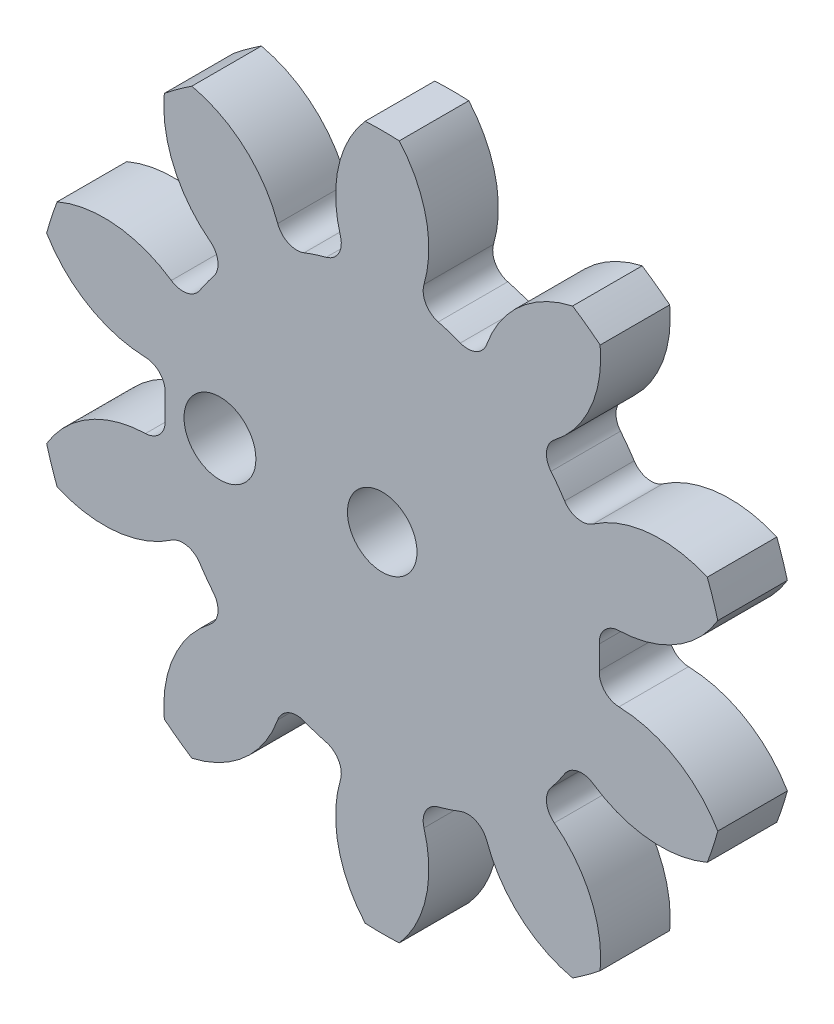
ISO-10303-21;
HEADER;
FILE_DESCRIPTION(('STEP AP214'),'2;1');
FILE_NAME('part.step','',(''),(''),'','','');
FILE_SCHEMA(('AUTOMOTIVE_DESIGN { 1 0 10303 214 1 1 1 1 }'));
ENDSEC;
DATA;
#1=APPLICATION_CONTEXT('core data for automotive mechanical design processes');
#2=APPLICATION_PROTOCOL_DEFINITION('international standard','automotive_design',2000,#1);
#3=PRODUCT_CONTEXT('',#1,'mechanical');
#4=PRODUCT('Part','Part','',(#3));
#5=PRODUCT_RELATED_PRODUCT_CATEGORY('part','',(#4));
#6=PRODUCT_DEFINITION_FORMATION('','',#4);
#7=PRODUCT_DEFINITION_CONTEXT('part definition',#1,'design');
#8=PRODUCT_DEFINITION('design','',#6,#7);
#9=PRODUCT_DEFINITION_SHAPE('','',#8);
#10=(LENGTH_UNIT() NAMED_UNIT(*) SI_UNIT(.MILLI.,.METRE.));
#11=(NAMED_UNIT(*) PLANE_ANGLE_UNIT() SI_UNIT($,.RADIAN.));
#12=(NAMED_UNIT(*) SI_UNIT($,.STERADIAN.) SOLID_ANGLE_UNIT());
#13=UNCERTAINTY_MEASURE_WITH_UNIT(LENGTH_MEASURE(1.E-05),#10,'distance_accuracy_value','');
#14=(GEOMETRIC_REPRESENTATION_CONTEXT(3) GLOBAL_UNCERTAINTY_ASSIGNED_CONTEXT((#13)) GLOBAL_UNIT_ASSIGNED_CONTEXT((#10,
#11,#12)) REPRESENTATION_CONTEXT('',''));
#15=CARTESIAN_POINT('',(0.,0.,0.));
#16=DIRECTION('',(0.,0.,1.));
#17=DIRECTION('',(1.,0.,0.));
#18=AXIS2_PLACEMENT_3D('',#15,#16,#17);
#19=CARTESIAN_POINT('',(0.,0.,6.));
#20=DIRECTION('',(0.,0.,-1.));
#21=DIRECTION('',(-1.,0.,0.));
#22=AXIS2_PLACEMENT_3D('',#19,#20,#21);
#23=CYLINDRICAL_SURFACE('',#22,18.75);
#24=CARTESIAN_POINT('',(0.,0.,6.));
#25=DIRECTION('',(0.,0.,1.));
#26=DIRECTION('',(1.,0.,0.));
#27=AXIS2_PLACEMENT_3D('',#24,#25,#26);
#28=CIRCLE('',#27,18.75);
#29=CARTESIAN_POINT('',(6.74042417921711,17.4965477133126,6.));
#30=VERTEX_POINT('',#29);
#31=CARTESIAN_POINT('',(4.83109500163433,18.1169263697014,6.));
#32=VERTEX_POINT('',#31);
#33=EDGE_CURVE('E655',#30,#32,#28,.T.);
#34=ORIENTED_EDGE('',*,*,#33,.F.);
#35=DIRECTION('',(0.,0.,-1.));
#36=VECTOR('',#35,1.);
#37=CARTESIAN_POINT('',(6.74042417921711,17.4965477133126,6.));
#38=LINE('',#37,#36);
#39=CARTESIAN_POINT('',(6.74042417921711,17.4965477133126,0.));
#40=VERTEX_POINT('',#39);
#41=EDGE_CURVE('E699',#30,#40,#38,.T.);
#42=ORIENTED_EDGE('',*,*,#41,.T.);
#43=CARTESIAN_POINT('',(0.,0.,0.));
#44=DIRECTION('',(0.,0.,1.));
#45=DIRECTION('',(1.,0.,0.));
#46=AXIS2_PLACEMENT_3D('',#43,#44,#45);
#47=CIRCLE('',#46,18.75);
#48=CARTESIAN_POINT('',(4.83109500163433,18.1169263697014,0.));
#49=VERTEX_POINT('',#48);
#50=EDGE_CURVE('E643',#40,#49,#47,.T.);
#51=ORIENTED_EDGE('',*,*,#50,.T.);
#52=DIRECTION('',(0.,0.,-1.));
#53=VECTOR('',#52,1.);
#54=CARTESIAN_POINT('',(4.83109500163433,18.1169263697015,6.));
#55=LINE('',#54,#53);
#56=EDGE_CURVE('E675',#49,#32,#55,.F.);
#57=ORIENTED_EDGE('',*,*,#56,.T.);
#58=EDGE_LOOP('',(#34,#42,#51,#57));
#59=FACE_BOUND('',#58,.T.);
#60=ADVANCED_FACE('F31',(#59),#23,.T.);
#61=CARTESIAN_POINT('',(-6.22828729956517,23.1968293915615,6.));
#62=DIRECTION('',(0.,0.,-1.));
#63=DIRECTION('',(-1.,0.,0.));
#64=AXIS2_PLACEMENT_3D('',#61,#62,#63);
#65=CYLINDRICAL_SURFACE('',#64,10.2488291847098);
#66=CARTESIAN_POINT('',(-6.22828729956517,23.1968293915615,6.));
#67=DIRECTION('',(0.,0.,-1.));
#68=DIRECTION('',(-1.,0.,0.));
#69=AXIS2_PLACEMENT_3D('',#66,#67,#68);
#70=CIRCLE('',#69,10.2488291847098);
#71=CARTESIAN_POINT('',(1.46869465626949,29.9640273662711,6.));
#72=VERTEX_POINT('',#71);
#73=CARTESIAN_POINT('',(3.60325025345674,20.3021154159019,6.));
#74=VERTEX_POINT('',#73);
#75=EDGE_CURVE('E657',#72,#74,#70,.T.);
#76=ORIENTED_EDGE('',*,*,#75,.T.);
#77=DIRECTION('',(0.,0.,-1.));
#78=VECTOR('',#77,1.);
#79=CARTESIAN_POINT('',(3.60325025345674,20.3021154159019,6.));
#80=LINE('',#79,#78);
#81=CARTESIAN_POINT('',(3.60325025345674,20.3021154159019,0.));
#82=VERTEX_POINT('',#81);
#83=EDGE_CURVE('E672',#74,#82,#80,.T.);
#84=ORIENTED_EDGE('',*,*,#83,.T.);
#85=CARTESIAN_POINT('',(-6.22828729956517,23.1968293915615,0.));
#86=DIRECTION('',(0.,0.,-1.));
#87=DIRECTION('',(-1.,0.,0.));
#88=AXIS2_PLACEMENT_3D('',#85,#86,#87);
#89=CIRCLE('',#88,10.2488291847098);
#90=CARTESIAN_POINT('',(1.46869465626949,29.9640273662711,0.));
#91=VERTEX_POINT('',#90);
#92=EDGE_CURVE('E645',#91,#82,#89,.T.);
#93=ORIENTED_EDGE('',*,*,#92,.F.);
#94=DIRECTION('',(0.,0.,-1.));
#95=VECTOR('',#94,1.);
#96=CARTESIAN_POINT('',(1.46869465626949,29.9640273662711,6.));
#97=LINE('',#96,#95);
#98=EDGE_CURVE('E670',#72,#91,#97,.T.);
#99=ORIENTED_EDGE('',*,*,#98,.F.);
#100=EDGE_LOOP('',(#76,#84,#93,#99));
#101=FACE_BOUND('',#100,.T.);
#102=ADVANCED_FACE('F892',(#101),#65,.T.);
#103=CARTESIAN_POINT('',(0.,0.,6.));
#104=DIRECTION('',(0.,0.,-1.));
#105=DIRECTION('',(-1.,0.,0.));
#106=AXIS2_PLACEMENT_3D('',#103,#104,#105);
#107=CYLINDRICAL_SURFACE('',#106,30.);
#108=CARTESIAN_POINT('',(0.,0.,0.));
#109=DIRECTION('',(0.,0.,1.));
#110=DIRECTION('',(1.,0.,0.));
#111=AXIS2_PLACEMENT_3D('',#108,#109,#110);
#112=CIRCLE('',#111,30.);
#113=CARTESIAN_POINT('',(-1.46869465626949,29.9640273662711,0.));
#114=VERTEX_POINT('',#113);
#115=EDGE_CURVE('E648',#91,#114,#112,.T.);
#116=ORIENTED_EDGE('',*,*,#115,.T.);
#117=DIRECTION('',(0.,0.,-1.));
#118=VECTOR('',#117,1.);
#119=CARTESIAN_POINT('',(-1.46869465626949,29.9640273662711,6.));
#120=LINE('',#119,#118);
#121=CARTESIAN_POINT('',(-1.46869465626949,29.9640273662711,6.));
#122=VERTEX_POINT('',#121);
#123=EDGE_CURVE('E667',#122,#114,#120,.T.);
#124=ORIENTED_EDGE('',*,*,#123,.F.);
#125=CARTESIAN_POINT('',(0.,0.,6.));
#126=DIRECTION('',(0.,0.,1.));
#127=DIRECTION('',(1.,0.,0.));
#128=AXIS2_PLACEMENT_3D('',#125,#126,#127);
#129=CIRCLE('',#128,30.);
#130=EDGE_CURVE('E660',#72,#122,#129,.T.);
#131=ORIENTED_EDGE('',*,*,#130,.F.);
#132=ORIENTED_EDGE('',*,*,#98,.T.);
#133=EDGE_LOOP('',(#116,#124,#131,#132));
#134=FACE_BOUND('',#133,.T.);
#135=ADVANCED_FACE('F888',(#134),#107,.T.);
#136=CARTESIAN_POINT('',(6.22828729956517,23.1968293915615,6.));
#137=DIRECTION('',(0.,0.,-1.));
#138=DIRECTION('',(-1.,0.,0.));
#139=AXIS2_PLACEMENT_3D('',#136,#137,#138);
#140=CYLINDRICAL_SURFACE('',#139,10.2488291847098);
#141=CARTESIAN_POINT('',(6.22828729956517,23.1968293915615,0.));
#142=DIRECTION('',(0.,0.,1.));
#143=DIRECTION('',(1.,0.,0.));
#144=AXIS2_PLACEMENT_3D('',#141,#142,#143);
#145=CIRCLE('',#144,10.2488291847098);
#146=CARTESIAN_POINT('',(-3.60325025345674,20.3021154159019,0.));
#147=VERTEX_POINT('',#146);
#148=EDGE_CURVE('E650',#114,#147,#145,.T.);
#149=ORIENTED_EDGE('',*,*,#148,.T.);
#150=DIRECTION('',(0.,0.,-1.));
#151=VECTOR('',#150,1.);
#152=CARTESIAN_POINT('',(-3.60325025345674,20.3021154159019,6.));
#153=LINE('',#152,#151);
#154=CARTESIAN_POINT('',(-3.60325025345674,20.3021154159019,6.));
#155=VERTEX_POINT('',#154);
#156=EDGE_CURVE('E681',#147,#155,#153,.F.);
#157=ORIENTED_EDGE('',*,*,#156,.T.);
#158=CARTESIAN_POINT('',(6.22828729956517,23.1968293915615,6.));
#159=DIRECTION('',(0.,0.,1.));
#160=DIRECTION('',(1.,0.,0.));
#161=AXIS2_PLACEMENT_3D('',#158,#159,#160);
#162=CIRCLE('',#161,10.2488291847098);
#163=EDGE_CURVE('E662',#122,#155,#162,.T.);
#164=ORIENTED_EDGE('',*,*,#163,.F.);
#165=ORIENTED_EDGE('',*,*,#123,.T.);
#166=EDGE_LOOP('',(#149,#157,#164,#165));
#167=FACE_BOUND('',#166,.T.);
#168=ADVANCED_FACE('F883',(#167),#140,.T.);
#169=CARTESIAN_POINT('',(0.,0.,6.));
#170=DIRECTION('',(0.,0.,-1.));
#171=DIRECTION('',(-1.,0.,0.));
#172=AXIS2_PLACEMENT_3D('',#169,#170,#171);
#173=CYLINDRICAL_SURFACE('',#172,18.75);
#174=CARTESIAN_POINT('',(0.,0.,0.));
#175=DIRECTION('',(0.,0.,-1.));
#176=DIRECTION('',(-1.,0.,0.));
#177=AXIS2_PLACEMENT_3D('',#174,#175,#176);
#178=CIRCLE('',#177,18.75);
#179=CARTESIAN_POINT('',(-6.74042417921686,17.4965477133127,0.));
#180=VERTEX_POINT('',#179);
#181=CARTESIAN_POINT('',(-4.83109500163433,18.1169263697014,0.));
#182=VERTEX_POINT('',#181);
#183=EDGE_CURVE('E653',#180,#182,#178,.T.);
#184=ORIENTED_EDGE('',*,*,#183,.F.);
#185=DIRECTION('',(0.,0.,-1.));
#186=VECTOR('',#185,1.);
#187=CARTESIAN_POINT('',(-6.74042417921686,17.4965477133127,6.));
#188=LINE('',#187,#186);
#189=CARTESIAN_POINT('',(-6.74042417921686,17.4965477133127,6.));
#190=VERTEX_POINT('',#189);
#191=EDGE_CURVE('E854',#180,#190,#188,.F.);
#192=ORIENTED_EDGE('',*,*,#191,.T.);
#193=CARTESIAN_POINT('',(0.,0.,6.));
#194=DIRECTION('',(0.,0.,-1.));
#195=DIRECTION('',(-1.,0.,0.));
#196=AXIS2_PLACEMENT_3D('',#193,#194,#195);
#197=CIRCLE('',#196,18.75);
#198=CARTESIAN_POINT('',(-4.83109500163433,18.1169263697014,6.));
#199=VERTEX_POINT('',#198);
#200=EDGE_CURVE('E665',#190,#199,#197,.T.);
#201=ORIENTED_EDGE('',*,*,#200,.T.);
#202=DIRECTION('',(0.,0.,-1.));
#203=VECTOR('',#202,1.);
#204=CARTESIAN_POINT('',(-4.83109500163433,18.1169263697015,6.));
#205=LINE('',#204,#203);
#206=EDGE_CURVE('E678',#199,#182,#205,.T.);
#207=ORIENTED_EDGE('',*,*,#206,.T.);
#208=EDGE_LOOP('',(#184,#192,#201,#207));
#209=FACE_BOUND('',#208,.T.);
#210=ADVANCED_FACE('F874',(#209),#173,.T.);
#211=CARTESIAN_POINT('',(0.,0.,6.));
#212=DIRECTION('',(0.,0.,1.));
#213=DIRECTION('',(1.,0.,0.));
#214=AXIS2_PLACEMENT_3D('',#211,#212,#213);
#215=PLANE('',#214);
#216=CARTESIAN_POINT('',(-14.,0.,6.));
#217=DIRECTION('',(0.,0.,1.));
#218=DIRECTION('',(1.,0.,0.));
#219=AXIS2_PLACEMENT_3D('',#216,#217,#218);
#220=CIRCLE('',#219,3.1);
#221=CARTESIAN_POINT('',(-10.9,0.,6.));
#222=VERTEX_POINT('',#221);
#223=EDGE_CURVE('E1598',#222,#222,#220,.T.);
#224=ORIENTED_EDGE('',*,*,#223,.F.);
#225=EDGE_LOOP('',(#224));
#226=FACE_BOUND('',#225,.T.);
#227=CARTESIAN_POINT('',(0.,0.,6.));
#228=DIRECTION('',(0.,0.,1.));
#229=DIRECTION('',(1.,0.,0.));
#230=AXIS2_PLACEMENT_3D('',#227,#228,#229);
#231=CIRCLE('',#230,3.);
#232=CARTESIAN_POINT('',(3.,0.,6.));
#233=VERTEX_POINT('',#232);
#234=EDGE_CURVE('E433',#233,#233,#231,.T.);
#235=ORIENTED_EDGE('',*,*,#234,.F.);
#236=EDGE_LOOP('',(#235));
#237=FACE_BOUND('',#236,.T.);
#238=CARTESIAN_POINT('',(18.6735444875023,15.1057337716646,6.));
#239=DIRECTION('',(0.,0.,1.));
#240=DIRECTION('',(0.809016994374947,-0.587785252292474,0.));
#241=AXIS2_PLACEMENT_3D('',#238,#239,#240);
#242=CIRCLE('',#241,10.2488291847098);
#243=CARTESIAN_POINT('',(16.4242144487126,25.1046844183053,6.));
#244=VERTEX_POINT('',#243);
#245=CARTESIAN_POINT('',(9.01819334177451,18.5426937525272,6.));
#246=VERTEX_POINT('',#245);
#247=EDGE_CURVE('E635',#244,#246,#242,.T.);
#248=ORIENTED_EDGE('',*,*,#247,.T.);
#249=CARTESIAN_POINT('',(7.36953043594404,19.1295588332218,6.));
#250=DIRECTION('',(0.,0.,1.));
#251=DIRECTION('',(1.,0.,0.));
#252=AXIS2_PLACEMENT_3D('',#249,#250,#251);
#253=CIRCLE('',#252,1.75);
#254=EDGE_CURVE('E711',#246,#30,#253,.F.);
#255=ORIENTED_EDGE('',*,*,#254,.T.);
#256=ORIENTED_EDGE('',*,*,#33,.T.);
#257=CARTESIAN_POINT('',(5.28199720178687,19.8078394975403,6.));
#258=DIRECTION('',(0.,0.,1.));
#259=DIRECTION('',(1.,0.,0.));
#260=AXIS2_PLACEMENT_3D('',#257,#258,#259);
#261=CIRCLE('',#260,1.75);
#262=EDGE_CURVE('E686',#32,#74,#261,.F.);
#263=ORIENTED_EDGE('',*,*,#262,.T.);
#264=ORIENTED_EDGE('',*,*,#75,.F.);
#265=ORIENTED_EDGE('',*,*,#130,.T.);
#266=ORIENTED_EDGE('',*,*,#163,.T.);
#267=CARTESIAN_POINT('',(-5.28199720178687,19.8078394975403,6.));
#268=DIRECTION('',(0.,0.,1.));
#269=DIRECTION('',(1.,0.,0.));
#270=AXIS2_PLACEMENT_3D('',#267,#268,#269);
#271=CIRCLE('',#270,1.75);
#272=EDGE_CURVE('E690',#155,#199,#271,.F.);
#273=ORIENTED_EDGE('',*,*,#272,.T.);
#274=ORIENTED_EDGE('',*,*,#200,.F.);
#275=CARTESIAN_POINT('',(-7.36953043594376,19.1295588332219,6.));
#276=DIRECTION('',(0.,0.,1.));
#277=DIRECTION('',(1.,0.,0.));
#278=AXIS2_PLACEMENT_3D('',#275,#276,#277);
#279=CIRCLE('',#278,1.75);
#280=CARTESIAN_POINT('',(-9.01819334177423,18.5426937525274,6.));
#281=VERTEX_POINT('',#280);
#282=EDGE_CURVE('E862',#190,#281,#279,.F.);
#283=ORIENTED_EDGE('',*,*,#282,.T.);
#284=CARTESIAN_POINT('',(-18.6735444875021,15.1057337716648,6.));
#285=DIRECTION('',(0.,0.,-1.));
#286=DIRECTION('',(-0.809016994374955,-0.587785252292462,0.));
#287=AXIS2_PLACEMENT_3D('',#284,#285,#286);
#288=CIRCLE('',#287,10.2488291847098);
#289=CARTESIAN_POINT('',(-16.4242144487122,25.1046844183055,6.));
#290=VERTEX_POINT('',#289);
#291=EDGE_CURVE('E438',#290,#281,#288,.T.);
#292=ORIENTED_EDGE('',*,*,#291,.F.);
#293=CARTESIAN_POINT('',(0.,0.,6.));
#294=DIRECTION('',(0.,0.,1.));
#295=DIRECTION('',(0.809016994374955,0.587785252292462,0.));
#296=AXIS2_PLACEMENT_3D('',#293,#294,#295);
#297=CIRCLE('',#296,30.);
#298=CARTESIAN_POINT('',(-18.8006123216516,23.3781303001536,6.));
#299=VERTEX_POINT('',#298);
#300=EDGE_CURVE('E413',#290,#299,#297,.T.);
#301=ORIENTED_EDGE('',*,*,#300,.T.);
#302=CARTESIAN_POINT('',(-8.59596394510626,22.4275246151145,6.));
#303=DIRECTION('',(0.,0.,1.));
#304=DIRECTION('',(0.809016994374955,0.587785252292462,0.));
#305=AXIS2_PLACEMENT_3D('',#302,#303,#304);
#306=CIRCLE('',#305,10.2488291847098);
#307=CARTESIAN_POINT('',(-14.848374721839,14.3068190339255,6.));
#308=VERTEX_POINT('',#307);
#309=EDGE_CURVE('E441',#299,#308,#306,.T.);
#310=ORIENTED_EDGE('',*,*,#309,.T.);
#311=CARTESIAN_POINT('',(-15.9159814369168,12.9201987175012,6.));
#312=DIRECTION('',(0.,0.,1.));
#313=DIRECTION('',(1.,0.,0.));
#314=AXIS2_PLACEMENT_3D('',#311,#312,#313);
#315=CIRCLE('',#314,1.75);
#316=CARTESIAN_POINT('',(-14.557300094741,11.8172549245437,6.));
#317=VERTEX_POINT('',#316);
#318=EDGE_CURVE('E11',#308,#317,#315,.F.);
#319=ORIENTED_EDGE('',*,*,#318,.T.);
#320=CARTESIAN_POINT('',(0.,0.,6.));
#321=DIRECTION('',(0.,0.,1.));
#322=DIRECTION('',(0.309016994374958,0.95105651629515,0.));
#323=AXIS2_PLACEMENT_3D('',#320,#321,#322);
#324=CIRCLE('',#323,18.75);
#325=CARTESIAN_POINT('',(-15.7373304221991,10.1930825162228,6.));
#326=VERTEX_POINT('',#325);
#327=EDGE_CURVE('E453',#317,#326,#324,.T.);
#328=ORIENTED_EDGE('',*,*,#327,.T.);
#329=CARTESIAN_POINT('',(-17.206147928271,11.1444368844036,6.));
#330=DIRECTION('',(0.,0.,1.));
#331=DIRECTION('',(1.,0.,0.));
#332=AXIS2_PLACEMENT_3D('',#329,#330,#331);
#333=CIRCLE('',#332,1.75);
#334=CARTESIAN_POINT('',(-18.1949935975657,9.70059331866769,6.));
#335=VERTEX_POINT('',#334);
#336=EDGE_CURVE('E847',#326,#335,#333,.F.);
#337=ORIENTED_EDGE('',*,*,#336,.T.);
#338=CARTESIAN_POINT('',(-23.9861423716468,1.24476127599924,6.));
#339=DIRECTION('',(0.,0.,-1.));
#340=DIRECTION('',(-0.309016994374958,-0.95105651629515,0.));
#341=AXIS2_PLACEMENT_3D('',#338,#339,#340);
#342=CIRCLE('',#341,10.2488291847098);
#343=CARTESIAN_POINT('',(-28.0436318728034,10.6562052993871,6.));
#344=VERTEX_POINT('',#343);
#345=EDGE_CURVE('E455',#344,#335,#342,.T.);
#346=ORIENTED_EDGE('',*,*,#345,.F.);
#347=CARTESIAN_POINT('',(0.,0.,6.));
#348=DIRECTION('',(0.,0.,1.));
#349=DIRECTION('',(0.309016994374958,0.95105651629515,0.));
#350=AXIS2_PLACEMENT_3D('',#347,#348,#349);
#351=CIRCLE('',#350,30.);
#352=CARTESIAN_POINT('',(-28.9513350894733,7.86258205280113,6.));
#353=VERTEX_POINT('',#352);
#354=EDGE_CURVE('E458',#344,#353,#351,.T.);
#355=ORIENTED_EDGE('',*,*,#354,.T.);
#356=CARTESIAN_POINT('',(-20.1368491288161,13.0916677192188,6.));
#357=DIRECTION('',(0.,0.,1.));
#358=DIRECTION('',(0.309016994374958,0.95105651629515,0.));
#359=AXIS2_PLACEMENT_3D('',#356,#357,#358);
#360=CIRCLE('',#359,10.2488291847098);
#361=CARTESIAN_POINT('',(-20.4219247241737,2.84680405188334,6.));
#362=VERTEX_POINT('',#361);
#363=EDGE_CURVE('E460',#353,#362,#360,.T.);
#364=ORIENTED_EDGE('',*,*,#363,.T.);
#365=CARTESIAN_POINT('',(-20.4706017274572,1.09748116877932,6.));
#366=DIRECTION('',(0.,0.,1.));
#367=DIRECTION('',(1.,0.,0.));
#368=AXIS2_PLACEMENT_3D('',#365,#366,#367);
#369=CIRCLE('',#368,1.75);
#370=CARTESIAN_POINT('',(-18.7231113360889,1.00379375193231,6.));
#371=VERTEX_POINT('',#370);
#372=EDGE_CURVE('E851',#362,#371,#369,.F.);
#373=ORIENTED_EDGE('',*,*,#372,.T.);
#374=CARTESIAN_POINT('',(0.,0.,6.));
#375=DIRECTION('',(0.,0.,1.));
#376=DIRECTION('',(-0.309016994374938,0.951056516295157,0.));
#377=AXIS2_PLACEMENT_3D('',#374,#375,#376);
#378=CIRCLE('',#377,18.75);
#379=CARTESIAN_POINT('',(-18.7231113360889,-1.00379375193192,6.));
#380=VERTEX_POINT('',#379);
#381=EDGE_CURVE('E478',#371,#380,#378,.T.);
#382=ORIENTED_EDGE('',*,*,#381,.T.);
#383=CARTESIAN_POINT('',(-20.4706017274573,-1.09748116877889,6.));
#384=DIRECTION('',(0.,0.,1.));
#385=DIRECTION('',(1.,0.,0.));
#386=AXIS2_PLACEMENT_3D('',#383,#384,#385);
#387=CIRCLE('',#386,1.75);
#388=CARTESIAN_POINT('',(-20.4219247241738,-2.84680405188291,6.));
#389=VERTEX_POINT('',#388);
#390=EDGE_CURVE('E827',#380,#389,#387,.F.);
#391=ORIENTED_EDGE('',*,*,#390,.T.);
#392=CARTESIAN_POINT('',(-20.1368491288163,-13.0916677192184,6.));
#393=DIRECTION('',(0.,0.,-1.));
#394=DIRECTION('',(0.309016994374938,-0.951056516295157,0.));
#395=AXIS2_PLACEMENT_3D('',#392,#393,#394);
#396=CIRCLE('',#395,10.2488291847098);
#397=CARTESIAN_POINT('',(-28.9513350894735,-7.86258205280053,6.));
#398=VERTEX_POINT('',#397);
#399=EDGE_CURVE('E480',#398,#389,#396,.T.);
#400=ORIENTED_EDGE('',*,*,#399,.F.);
#401=CARTESIAN_POINT('',(0.,0.,6.));
#402=DIRECTION('',(0.,0.,1.));
#403=DIRECTION('',(-0.309016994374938,0.951056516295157,0.));
#404=AXIS2_PLACEMENT_3D('',#401,#402,#403);
#405=CIRCLE('',#404,30.);
#406=CARTESIAN_POINT('',(-28.0436318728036,-10.6562052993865,6.));
#407=VERTEX_POINT('',#406);
#408=EDGE_CURVE('E483',#398,#407,#405,.T.);
#409=ORIENTED_EDGE('',*,*,#408,.T.);
#410=CARTESIAN_POINT('',(-23.9861423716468,-1.24476127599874,6.));
#411=DIRECTION('',(0.,0.,1.));
#412=DIRECTION('',(-0.309016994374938,0.951056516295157,0.));
#413=AXIS2_PLACEMENT_3D('',#410,#411,#412);
#414=CIRCLE('',#413,10.2488291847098);
#415=CARTESIAN_POINT('',(-18.1949935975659,-9.70059331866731,6.));
#416=VERTEX_POINT('',#415);
#417=EDGE_CURVE('E485',#407,#416,#414,.T.);
#418=ORIENTED_EDGE('',*,*,#417,.T.);
#419=CARTESIAN_POINT('',(-17.2061479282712,-11.1444368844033,6.));
#420=DIRECTION('',(0.,0.,1.));
#421=DIRECTION('',(1.,0.,0.));
#422=AXIS2_PLACEMENT_3D('',#419,#420,#421);
#423=CIRCLE('',#422,1.75);
#424=CARTESIAN_POINT('',(-15.7373304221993,-10.1930825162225,6.));
#425=VERTEX_POINT('',#424);
#426=EDGE_CURVE('E831',#416,#425,#423,.F.);
#427=ORIENTED_EDGE('',*,*,#426,.T.);
#428=CARTESIAN_POINT('',(0.,0.,6.));
#429=DIRECTION('',(0.,0.,1.));
#430=DIRECTION('',(-0.809016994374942,0.58778525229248,0.));
#431=AXIS2_PLACEMENT_3D('',#428,#429,#430);
#432=CIRCLE('',#431,18.75);
#433=CARTESIAN_POINT('',(-14.5573000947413,-11.8172549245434,6.));
#434=VERTEX_POINT('',#433);
#435=EDGE_CURVE('E503',#425,#434,#432,.T.);
#436=ORIENTED_EDGE('',*,*,#435,.T.);
#437=CARTESIAN_POINT('',(-15.9159814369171,-12.9201987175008,6.));
#438=DIRECTION('',(0.,0.,1.));
#439=DIRECTION('',(1.,0.,0.));
#440=AXIS2_PLACEMENT_3D('',#437,#438,#439);
#441=CIRCLE('',#440,1.75);
#442=CARTESIAN_POINT('',(-14.8483747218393,-14.3068190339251,6.));
#443=VERTEX_POINT('',#442);
#444=EDGE_CURVE('E807',#434,#443,#441,.F.);
#445=ORIENTED_EDGE('',*,*,#444,.T.);
#446=CARTESIAN_POINT('',(-8.59596394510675,-22.4275246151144,6.));
#447=DIRECTION('',(0.,0.,-1.));
#448=DIRECTION('',(0.809016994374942,-0.58778525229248,0.));
#449=AXIS2_PLACEMENT_3D('',#446,#447,#448);
#450=CIRCLE('',#449,10.2488291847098);
#451=CARTESIAN_POINT('',(-18.8006123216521,-23.3781303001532,6.));
#452=VERTEX_POINT('',#451);
#453=EDGE_CURVE('E505',#452,#443,#450,.T.);
#454=ORIENTED_EDGE('',*,*,#453,.F.);
#455=CARTESIAN_POINT('',(0.,0.,6.));
#456=DIRECTION('',(0.,0.,1.));
#457=DIRECTION('',(-0.809016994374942,0.58778525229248,0.));
#458=AXIS2_PLACEMENT_3D('',#455,#456,#457);
#459=CIRCLE('',#458,30.);
#460=CARTESIAN_POINT('',(-16.4242144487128,-25.1046844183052,6.));
#461=VERTEX_POINT('',#460);
#462=EDGE_CURVE('E508',#452,#461,#459,.T.);
#463=ORIENTED_EDGE('',*,*,#462,.T.);
#464=CARTESIAN_POINT('',(-18.6735444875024,-15.1057337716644,6.));
#465=DIRECTION('',(0.,0.,1.));
#466=DIRECTION('',(-0.809016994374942,0.58778525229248,0.));
#467=AXIS2_PLACEMENT_3D('',#464,#465,#466);
#468=CIRCLE('',#467,10.2488291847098);
#469=CARTESIAN_POINT('',(-9.01819334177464,-18.5426937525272,6.));
#470=VERTEX_POINT('',#469);
#471=EDGE_CURVE('E510',#461,#470,#468,.T.);
#472=ORIENTED_EDGE('',*,*,#471,.T.);
#473=CARTESIAN_POINT('',(-7.36953043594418,-19.1295588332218,6.));
#474=DIRECTION('',(0.,0.,1.));
#475=DIRECTION('',(1.,0.,0.));
#476=AXIS2_PLACEMENT_3D('',#473,#474,#475);
#477=CIRCLE('',#476,1.75);
#478=CARTESIAN_POINT('',(-6.74042417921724,-17.4965477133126,6.));
#479=VERTEX_POINT('',#478);
#480=EDGE_CURVE('E811',#470,#479,#477,.F.);
#481=ORIENTED_EDGE('',*,*,#480,.T.);
#482=CARTESIAN_POINT('',(0.,0.,6.));
#483=DIRECTION('',(0.,0.,1.));
#484=DIRECTION('',(-1.,0.,0.));
#485=AXIS2_PLACEMENT_3D('',#482,#483,#484);
#486=CIRCLE('',#485,18.75);
#487=CARTESIAN_POINT('',(-4.83109500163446,-18.1169263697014,6.));
#488=VERTEX_POINT('',#487);
#489=EDGE_CURVE('E528',#479,#488,#486,.T.);
#490=ORIENTED_EDGE('',*,*,#489,.T.);
#491=CARTESIAN_POINT('',(-5.28199720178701,-19.8078394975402,6.));
#492=DIRECTION('',(0.,0.,1.));
#493=DIRECTION('',(1.,0.,0.));
#494=AXIS2_PLACEMENT_3D('',#491,#492,#493);
#495=CIRCLE('',#494,1.75);
#496=CARTESIAN_POINT('',(-3.60325025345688,-20.3021154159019,6.));
#497=VERTEX_POINT('',#496);
#498=EDGE_CURVE('E787',#488,#497,#495,.F.);
#499=ORIENTED_EDGE('',*,*,#498,.T.);
#500=CARTESIAN_POINT('',(6.22828729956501,-23.1968293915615,6.));
#501=DIRECTION('',(0.,0.,-1.));
#502=DIRECTION('',(1.,0.,0.));
#503=AXIS2_PLACEMENT_3D('',#500,#501,#502);
#504=CIRCLE('',#503,10.2488291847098);
#505=CARTESIAN_POINT('',(-1.4686946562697,-29.9640273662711,6.));
#506=VERTEX_POINT('',#505);
#507=EDGE_CURVE('E530',#506,#497,#504,.T.);
#508=ORIENTED_EDGE('',*,*,#507,.F.);
#509=CARTESIAN_POINT('',(0.,0.,6.));
#510=DIRECTION('',(0.,0.,1.));
#511=DIRECTION('',(-1.,0.,0.));
#512=AXIS2_PLACEMENT_3D('',#509,#510,#511);
#513=CIRCLE('',#512,30.);
#514=CARTESIAN_POINT('',(1.46869465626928,-29.9640273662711,6.));
#515=VERTEX_POINT('',#514);
#516=EDGE_CURVE('E533',#506,#515,#513,.T.);
#517=ORIENTED_EDGE('',*,*,#516,.T.);
#518=CARTESIAN_POINT('',(-6.22828729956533,-23.1968293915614,6.));
#519=DIRECTION('',(0.,0.,1.));
#520=DIRECTION('',(-1.,0.,0.));
#521=AXIS2_PLACEMENT_3D('',#518,#519,#520);
#522=CIRCLE('',#521,10.2488291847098);
#523=CARTESIAN_POINT('',(3.60325025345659,-20.3021154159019,6.));
#524=VERTEX_POINT('',#523);
#525=EDGE_CURVE('E535',#515,#524,#522,.T.);
#526=ORIENTED_EDGE('',*,*,#525,.T.);
#527=CARTESIAN_POINT('',(5.28199720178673,-19.8078394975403,6.));
#528=DIRECTION('',(0.,0.,1.));
#529=DIRECTION('',(1.,0.,0.));
#530=AXIS2_PLACEMENT_3D('',#527,#528,#529);
#531=CIRCLE('',#530,1.75);
#532=CARTESIAN_POINT('',(4.8310950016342,-18.1169263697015,6.));
#533=VERTEX_POINT('',#532);
#534=EDGE_CURVE('E791',#524,#533,#531,.F.);
#535=ORIENTED_EDGE('',*,*,#534,.T.);
#536=CARTESIAN_POINT('',(0.,0.,6.));
#537=DIRECTION('',(0.,0.,1.));
#538=DIRECTION('',(-0.809016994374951,-0.587785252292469,0.));
#539=AXIS2_PLACEMENT_3D('',#536,#537,#538);
#540=CIRCLE('',#539,18.75);
#541=CARTESIAN_POINT('',(6.74042417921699,-17.4965477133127,6.));
#542=VERTEX_POINT('',#541);
#543=EDGE_CURVE('E553',#533,#542,#540,.T.);
#544=ORIENTED_EDGE('',*,*,#543,.T.);
#545=CARTESIAN_POINT('',(7.36953043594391,-19.1295588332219,6.));
#546=DIRECTION('',(0.,0.,1.));
#547=DIRECTION('',(1.,0.,0.));
#548=AXIS2_PLACEMENT_3D('',#545,#546,#547);
#549=CIRCLE('',#548,1.75);
#550=CARTESIAN_POINT('',(9.01819334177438,-18.5426937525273,6.));
#551=VERTEX_POINT('',#550);
#552=EDGE_CURVE('E767',#542,#551,#549,.F.);
#553=ORIENTED_EDGE('',*,*,#552,.T.);
#554=CARTESIAN_POINT('',(18.6735444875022,-15.1057337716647,6.));
#555=DIRECTION('',(0.,0.,-1.));
#556=DIRECTION('',(0.809016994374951,0.587785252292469,0.));
#557=AXIS2_PLACEMENT_3D('',#554,#555,#556);
#558=CIRCLE('',#557,10.2488291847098);
#559=CARTESIAN_POINT('',(16.4242144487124,-25.1046844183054,6.));
#560=VERTEX_POINT('',#559);
#561=EDGE_CURVE('E555',#560,#551,#558,.T.);
#562=ORIENTED_EDGE('',*,*,#561,.F.);
#563=CARTESIAN_POINT('',(0.,0.,6.));
#564=DIRECTION('',(0.,0.,1.));
#565=DIRECTION('',(-0.809016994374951,-0.587785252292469,0.));
#566=AXIS2_PLACEMENT_3D('',#563,#564,#565);
#567=CIRCLE('',#566,30.);
#568=CARTESIAN_POINT('',(18.8006123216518,-23.3781303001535,6.));
#569=VERTEX_POINT('',#568);
#570=EDGE_CURVE('E558',#560,#569,#567,.T.);
#571=ORIENTED_EDGE('',*,*,#570,.T.);
#572=CARTESIAN_POINT('',(8.59596394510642,-22.4275246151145,6.));
#573=DIRECTION('',(0.,0.,1.));
#574=DIRECTION('',(-0.809016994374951,-0.587785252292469,0.));
#575=AXIS2_PLACEMENT_3D('',#572,#573,#574);
#576=CIRCLE('',#575,10.2488291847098);
#577=CARTESIAN_POINT('',(14.8483747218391,-14.3068190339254,6.));
#578=VERTEX_POINT('',#577);
#579=EDGE_CURVE('E560',#569,#578,#576,.T.);
#580=ORIENTED_EDGE('',*,*,#579,.T.);
#581=CARTESIAN_POINT('',(15.9159814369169,-12.920198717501,6.));
#582=DIRECTION('',(0.,0.,1.));
#583=DIRECTION('',(1.,0.,0.));
#584=AXIS2_PLACEMENT_3D('',#581,#582,#583);
#585=CIRCLE('',#584,1.75);
#586=CARTESIAN_POINT('',(14.5573000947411,-11.8172549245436,6.));
#587=VERTEX_POINT('',#586);
#588=EDGE_CURVE('E771',#578,#587,#585,.F.);
#589=ORIENTED_EDGE('',*,*,#588,.T.);
#590=CARTESIAN_POINT('',(0.,0.,6.));
#591=DIRECTION('',(0.,0.,1.));
#592=DIRECTION('',(-0.309016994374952,-0.951056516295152,0.));
#593=AXIS2_PLACEMENT_3D('',#590,#591,#592);
#594=CIRCLE('',#593,18.75);
#595=CARTESIAN_POINT('',(15.7373304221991,-10.1930825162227,6.));
#596=VERTEX_POINT('',#595);
#597=EDGE_CURVE('E578',#587,#596,#594,.T.);
#598=ORIENTED_EDGE('',*,*,#597,.T.);
#599=CARTESIAN_POINT('',(17.2061479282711,-11.1444368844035,6.));
#600=DIRECTION('',(0.,0.,1.));
#601=DIRECTION('',(1.,0.,0.));
#602=AXIS2_PLACEMENT_3D('',#599,#600,#601);
#603=CIRCLE('',#602,1.75);
#604=CARTESIAN_POINT('',(18.1949935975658,-9.70059331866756,6.));
#605=VERTEX_POINT('',#604);
#606=EDGE_CURVE('E747',#596,#605,#603,.F.);
#607=ORIENTED_EDGE('',*,*,#606,.T.);
#608=CARTESIAN_POINT('',(23.9861423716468,-1.24476127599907,6.));
#609=DIRECTION('',(0.,0.,-1.));
#610=DIRECTION('',(0.309016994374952,0.951056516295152,0.));
#611=AXIS2_PLACEMENT_3D('',#608,#609,#610);
#612=CIRCLE('',#611,10.2488291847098);
#613=CARTESIAN_POINT('',(28.0436318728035,-10.6562052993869,6.));
#614=VERTEX_POINT('',#613);
#615=EDGE_CURVE('E580',#614,#605,#612,.T.);
#616=ORIENTED_EDGE('',*,*,#615,.F.);
#617=CARTESIAN_POINT('',(0.,0.,6.));
#618=DIRECTION('',(0.,0.,1.));
#619=DIRECTION('',(-0.309016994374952,-0.951056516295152,0.));
#620=AXIS2_PLACEMENT_3D('',#617,#618,#619);
#621=CIRCLE('',#620,30.);
#622=CARTESIAN_POINT('',(28.9513350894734,-7.86258205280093,6.));
#623=VERTEX_POINT('',#622);
#624=EDGE_CURVE('E583',#614,#623,#621,.T.);
#625=ORIENTED_EDGE('',*,*,#624,.T.);
#626=CARTESIAN_POINT('',(20.1368491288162,-13.0916677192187,6.));
#627=DIRECTION('',(0.,0.,1.));
#628=DIRECTION('',(-0.309016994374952,-0.951056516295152,0.));
#629=AXIS2_PLACEMENT_3D('',#626,#627,#628);
#630=CIRCLE('',#629,10.2488291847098);
#631=CARTESIAN_POINT('',(20.4219247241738,-2.8468040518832,6.));
#632=VERTEX_POINT('',#631);
#633=EDGE_CURVE('E585',#623,#632,#630,.T.);
#634=ORIENTED_EDGE('',*,*,#633,.T.);
#635=CARTESIAN_POINT('',(20.4706017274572,-1.09748116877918,6.));
#636=DIRECTION('',(0.,0.,1.));
#637=DIRECTION('',(1.,0.,0.));
#638=AXIS2_PLACEMENT_3D('',#635,#636,#637);
#639=CIRCLE('',#638,1.75);
#640=CARTESIAN_POINT('',(18.7231113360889,-1.00379375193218,6.));
#641=VERTEX_POINT('',#640);
#642=EDGE_CURVE('E751',#632,#641,#639,.F.);
#643=ORIENTED_EDGE('',*,*,#642,.T.);
#644=CARTESIAN_POINT('',(0.,0.,6.));
#645=DIRECTION('',(0.,0.,1.));
#646=DIRECTION('',(0.309016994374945,-0.951056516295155,0.));
#647=AXIS2_PLACEMENT_3D('',#644,#645,#646);
#648=CIRCLE('',#647,18.75);
#649=CARTESIAN_POINT('',(18.7231113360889,1.00379375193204,6.));
#650=VERTEX_POINT('',#649);
#651=EDGE_CURVE('E603',#641,#650,#648,.T.);
#652=ORIENTED_EDGE('',*,*,#651,.T.);
#653=CARTESIAN_POINT('',(20.4706017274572,1.09748116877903,6.));
#654=DIRECTION('',(0.,0.,1.));
#655=DIRECTION('',(1.,0.,0.));
#656=AXIS2_PLACEMENT_3D('',#653,#654,#655);
#657=CIRCLE('',#656,1.75);
#658=CARTESIAN_POINT('',(20.4219247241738,2.84680405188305,6.));
#659=VERTEX_POINT('',#658);
#660=EDGE_CURVE('E727',#650,#659,#657,.F.);
#661=ORIENTED_EDGE('',*,*,#660,.T.);
#662=CARTESIAN_POINT('',(20.1368491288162,13.0916677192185,6.));
#663=DIRECTION('',(0.,0.,-1.));
#664=DIRECTION('',(-0.309016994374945,0.951056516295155,0.));
#665=AXIS2_PLACEMENT_3D('',#662,#663,#664);
#666=CIRCLE('',#665,10.2488291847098);
#667=CARTESIAN_POINT('',(28.9513350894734,7.86258205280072,6.));
#668=VERTEX_POINT('',#667);
#669=EDGE_CURVE('E605',#668,#659,#666,.T.);
#670=ORIENTED_EDGE('',*,*,#669,.F.);
#671=CARTESIAN_POINT('',(0.,0.,6.));
#672=DIRECTION('',(0.,0.,1.));
#673=DIRECTION('',(0.309016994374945,-0.951056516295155,0.));
#674=AXIS2_PLACEMENT_3D('',#671,#672,#673);
#675=CIRCLE('',#674,30.);
#676=CARTESIAN_POINT('',(28.0436318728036,10.6562052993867,6.));
#677=VERTEX_POINT('',#676);
#678=EDGE_CURVE('E608',#668,#677,#675,.T.);
#679=ORIENTED_EDGE('',*,*,#678,.T.);
#680=CARTESIAN_POINT('',(23.9861423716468,1.2447612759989,6.));
#681=DIRECTION('',(0.,0.,1.));
#682=DIRECTION('',(0.309016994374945,-0.951056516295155,0.));
#683=AXIS2_PLACEMENT_3D('',#680,#681,#682);
#684=CIRCLE('',#683,10.2488291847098);
#685=CARTESIAN_POINT('',(18.1949935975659,9.70059331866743,6.));
#686=VERTEX_POINT('',#685);
#687=EDGE_CURVE('E610',#677,#686,#684,.T.);
#688=ORIENTED_EDGE('',*,*,#687,.T.);
#689=CARTESIAN_POINT('',(17.2061479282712,11.1444368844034,6.));
#690=DIRECTION('',(0.,0.,1.));
#691=DIRECTION('',(1.,0.,0.));
#692=AXIS2_PLACEMENT_3D('',#689,#690,#691);
#693=CIRCLE('',#692,1.75);
#694=CARTESIAN_POINT('',(15.7373304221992,10.1930825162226,6.));
#695=VERTEX_POINT('',#694);
#696=EDGE_CURVE('E731',#686,#695,#693,.F.);
#697=ORIENTED_EDGE('',*,*,#696,.T.);
#698=CARTESIAN_POINT('',(0.,0.,6.));
#699=DIRECTION('',(0.,0.,1.));
#700=DIRECTION('',(0.809016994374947,-0.587785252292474,0.));
#701=AXIS2_PLACEMENT_3D('',#698,#699,#700);
#702=CIRCLE('',#701,18.75);
#703=CARTESIAN_POINT('',(14.5573000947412,11.8172549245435,6.));
#704=VERTEX_POINT('',#703);
#705=EDGE_CURVE('E628',#695,#704,#702,.T.);
#706=ORIENTED_EDGE('',*,*,#705,.T.);
#707=CARTESIAN_POINT('',(15.915981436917,12.9201987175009,6.));
#708=DIRECTION('',(0.,0.,1.));
#709=DIRECTION('',(1.,0.,0.));
#710=AXIS2_PLACEMENT_3D('',#707,#708,#709);
#711=CIRCLE('',#710,1.75);
#712=CARTESIAN_POINT('',(14.8483747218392,14.3068190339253,6.));
#713=VERTEX_POINT('',#712);
#714=EDGE_CURVE('E707',#704,#713,#711,.F.);
#715=ORIENTED_EDGE('',*,*,#714,.T.);
#716=CARTESIAN_POINT('',(8.59596394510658,22.4275246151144,6.));
#717=DIRECTION('',(0.,0.,-1.));
#718=DIRECTION('',(-0.809016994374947,0.587785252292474,0.));
#719=AXIS2_PLACEMENT_3D('',#716,#717,#718);
#720=CIRCLE('',#719,10.2488291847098);
#721=CARTESIAN_POINT('',(18.800612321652,23.3781303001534,6.));
#722=VERTEX_POINT('',#721);
#723=EDGE_CURVE('E630',#722,#713,#720,.T.);
#724=ORIENTED_EDGE('',*,*,#723,.F.);
#725=CARTESIAN_POINT('',(0.,0.,6.));
#726=DIRECTION('',(0.,0.,1.));
#727=DIRECTION('',(0.809016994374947,-0.587785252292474,0.));
#728=AXIS2_PLACEMENT_3D('',#725,#726,#727);
#729=CIRCLE('',#728,30.);
#730=EDGE_CURVE('E633',#722,#244,#729,.T.);
#731=ORIENTED_EDGE('',*,*,#730,.T.);
#732=EDGE_LOOP('',(#248,#255,#256,#263,#264,#265,#266,#273,#274,#283,#292,#301,#310,#319,#328,
#337,#346,#355,#364,#373,#382,#391,#400,#409,#418,#427,#436,#445,#454,#463,#472,#481,#490,#499,
#508,#517,#526,#535,#544,#553,#562,#571,#580,#589,#598,#607,#616,#625,#634,#643,#652,#661,#670,
#679,#688,#697,#706,#715,#724,#731));
#733=FACE_BOUND('',#732,.T.);
#734=ADVANCED_FACE('F867',(#226,#237,#733),#215,.T.);
#735=CARTESIAN_POINT('',(0.,0.,0.));
#736=DIRECTION('',(0.,0.,1.));
#737=DIRECTION('',(1.,0.,0.));
#738=AXIS2_PLACEMENT_3D('',#735,#736,#737);
#739=PLANE('',#738);
#740=CARTESIAN_POINT('',(-14.,0.,0.));
#741=DIRECTION('',(0.,0.,1.));
#742=DIRECTION('',(1.,0.,0.));
#743=AXIS2_PLACEMENT_3D('',#740,#741,#742);
#744=CIRCLE('',#743,3.1);
#745=CARTESIAN_POINT('',(-10.9,0.,0.));
#746=VERTEX_POINT('',#745);
#747=EDGE_CURVE('E1595',#746,#746,#744,.T.);
#748=ORIENTED_EDGE('',*,*,#747,.T.);
#749=EDGE_LOOP('',(#748));
#750=FACE_BOUND('',#749,.T.);
#751=CARTESIAN_POINT('',(0.,0.,0.));
#752=DIRECTION('',(0.,0.,1.));
#753=DIRECTION('',(1.,0.,0.));
#754=AXIS2_PLACEMENT_3D('',#751,#752,#753);
#755=CIRCLE('',#754,3.);
#756=CARTESIAN_POINT('',(3.,0.,0.));
#757=VERTEX_POINT('',#756);
#758=EDGE_CURVE('E34',#757,#757,#755,.T.);
#759=ORIENTED_EDGE('',*,*,#758,.T.);
#760=EDGE_LOOP('',(#759));
#761=FACE_BOUND('',#760,.T.);
#762=ORIENTED_EDGE('',*,*,#50,.F.);
#763=CARTESIAN_POINT('',(7.36953043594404,19.1295588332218,0.));
#764=DIRECTION('',(0.,0.,1.));
#765=DIRECTION('',(1.,0.,0.));
#766=AXIS2_PLACEMENT_3D('',#763,#764,#765);
#767=CIRCLE('',#766,1.75);
#768=CARTESIAN_POINT('',(9.01819334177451,18.5426937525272,0.));
#769=VERTEX_POINT('',#768);
#770=EDGE_CURVE('E709',#40,#769,#767,.T.);
#771=ORIENTED_EDGE('',*,*,#770,.T.);
#772=CARTESIAN_POINT('',(18.6735444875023,15.1057337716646,0.));
#773=DIRECTION('',(0.,0.,1.));
#774=DIRECTION('',(0.809016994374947,-0.587785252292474,0.));
#775=AXIS2_PLACEMENT_3D('',#772,#773,#774);
#776=CIRCLE('',#775,10.2488291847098);
#777=CARTESIAN_POINT('',(16.4242144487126,25.1046844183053,0.));
#778=VERTEX_POINT('',#777);
#779=EDGE_CURVE('E625',#778,#769,#776,.T.);
#780=ORIENTED_EDGE('',*,*,#779,.F.);
#781=CARTESIAN_POINT('',(0.,0.,0.));
#782=DIRECTION('',(0.,0.,1.));
#783=DIRECTION('',(0.809016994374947,-0.587785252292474,0.));
#784=AXIS2_PLACEMENT_3D('',#781,#782,#783);
#785=CIRCLE('',#784,30.);
#786=CARTESIAN_POINT('',(18.800612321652,23.3781303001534,0.));
#787=VERTEX_POINT('',#786);
#788=EDGE_CURVE('E623',#787,#778,#785,.T.);
#789=ORIENTED_EDGE('',*,*,#788,.F.);
#790=CARTESIAN_POINT('',(8.59596394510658,22.4275246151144,0.));
#791=DIRECTION('',(0.,0.,-1.));
#792=DIRECTION('',(-0.809016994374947,0.587785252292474,0.));
#793=AXIS2_PLACEMENT_3D('',#790,#791,#792);
#794=CIRCLE('',#793,10.2488291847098);
#795=CARTESIAN_POINT('',(14.8483747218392,14.3068190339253,0.));
#796=VERTEX_POINT('',#795);
#797=EDGE_CURVE('E620',#787,#796,#794,.T.);
#798=ORIENTED_EDGE('',*,*,#797,.T.);
#799=CARTESIAN_POINT('',(15.915981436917,12.9201987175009,0.));
#800=DIRECTION('',(0.,0.,1.));
#801=DIRECTION('',(1.,0.,0.));
#802=AXIS2_PLACEMENT_3D('',#799,#800,#801);
#803=CIRCLE('',#802,1.75);
#804=CARTESIAN_POINT('',(14.5573000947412,11.8172549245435,0.));
#805=VERTEX_POINT('',#804);
#806=EDGE_CURVE('E704',#796,#805,#803,.T.);
#807=ORIENTED_EDGE('',*,*,#806,.T.);
#808=CARTESIAN_POINT('',(0.,0.,0.));
#809=DIRECTION('',(0.,0.,1.));
#810=DIRECTION('',(0.809016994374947,-0.587785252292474,0.));
#811=AXIS2_PLACEMENT_3D('',#808,#809,#810);
#812=CIRCLE('',#811,18.75);
#813=CARTESIAN_POINT('',(15.7373304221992,10.1930825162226,0.));
#814=VERTEX_POINT('',#813);
#815=EDGE_CURVE('E618',#814,#805,#812,.T.);
#816=ORIENTED_EDGE('',*,*,#815,.F.);
#817=CARTESIAN_POINT('',(17.2061479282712,11.1444368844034,0.));
#818=DIRECTION('',(0.,0.,1.));
#819=DIRECTION('',(1.,0.,0.));
#820=AXIS2_PLACEMENT_3D('',#817,#818,#819);
#821=CIRCLE('',#820,1.75);
#822=CARTESIAN_POINT('',(18.1949935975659,9.70059331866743,0.));
#823=VERTEX_POINT('',#822);
#824=EDGE_CURVE('E729',#814,#823,#821,.T.);
#825=ORIENTED_EDGE('',*,*,#824,.T.);
#826=CARTESIAN_POINT('',(23.9861423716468,1.2447612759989,0.));
#827=DIRECTION('',(0.,0.,1.));
#828=DIRECTION('',(0.309016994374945,-0.951056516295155,0.));
#829=AXIS2_PLACEMENT_3D('',#826,#827,#828);
#830=CIRCLE('',#829,10.2488291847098);
#831=CARTESIAN_POINT('',(28.0436318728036,10.6562052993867,0.));
#832=VERTEX_POINT('',#831);
#833=EDGE_CURVE('E600',#832,#823,#830,.T.);
#834=ORIENTED_EDGE('',*,*,#833,.F.);
#835=CARTESIAN_POINT('',(0.,0.,0.));
#836=DIRECTION('',(0.,0.,1.));
#837=DIRECTION('',(0.309016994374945,-0.951056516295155,0.));
#838=AXIS2_PLACEMENT_3D('',#835,#836,#837);
#839=CIRCLE('',#838,30.);
#840=CARTESIAN_POINT('',(28.9513350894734,7.86258205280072,0.));
#841=VERTEX_POINT('',#840);
#842=EDGE_CURVE('E598',#841,#832,#839,.T.);
#843=ORIENTED_EDGE('',*,*,#842,.F.);
#844=CARTESIAN_POINT('',(20.1368491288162,13.0916677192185,0.));
#845=DIRECTION('',(0.,0.,-1.));
#846=DIRECTION('',(-0.309016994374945,0.951056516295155,0.));
#847=AXIS2_PLACEMENT_3D('',#844,#845,#846);
#848=CIRCLE('',#847,10.2488291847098);
#849=CARTESIAN_POINT('',(20.4219247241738,2.84680405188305,0.));
#850=VERTEX_POINT('',#849);
#851=EDGE_CURVE('E595',#841,#850,#848,.T.);
#852=ORIENTED_EDGE('',*,*,#851,.T.);
#853=CARTESIAN_POINT('',(20.4706017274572,1.09748116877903,0.));
#854=DIRECTION('',(0.,0.,1.));
#855=DIRECTION('',(1.,0.,0.));
#856=AXIS2_PLACEMENT_3D('',#853,#854,#855);
#857=CIRCLE('',#856,1.75);
#858=CARTESIAN_POINT('',(18.7231113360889,1.00379375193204,0.));
#859=VERTEX_POINT('',#858);
#860=EDGE_CURVE('E724',#850,#859,#857,.T.);
#861=ORIENTED_EDGE('',*,*,#860,.T.);
#862=CARTESIAN_POINT('',(0.,0.,0.));
#863=DIRECTION('',(0.,0.,1.));
#864=DIRECTION('',(0.309016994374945,-0.951056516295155,0.));
#865=AXIS2_PLACEMENT_3D('',#862,#863,#864);
#866=CIRCLE('',#865,18.75);
#867=CARTESIAN_POINT('',(18.7231113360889,-1.00379375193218,0.));
#868=VERTEX_POINT('',#867);
#869=EDGE_CURVE('E593',#868,#859,#866,.T.);
#870=ORIENTED_EDGE('',*,*,#869,.F.);
#871=CARTESIAN_POINT('',(20.4706017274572,-1.09748116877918,0.));
#872=DIRECTION('',(0.,0.,1.));
#873=DIRECTION('',(1.,0.,0.));
#874=AXIS2_PLACEMENT_3D('',#871,#872,#873);
#875=CIRCLE('',#874,1.75);
#876=CARTESIAN_POINT('',(20.4219247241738,-2.8468040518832,0.));
#877=VERTEX_POINT('',#876);
#878=EDGE_CURVE('E749',#868,#877,#875,.T.);
#879=ORIENTED_EDGE('',*,*,#878,.T.);
#880=CARTESIAN_POINT('',(20.1368491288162,-13.0916677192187,0.));
#881=DIRECTION('',(0.,0.,1.));
#882=DIRECTION('',(-0.309016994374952,-0.951056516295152,0.));
#883=AXIS2_PLACEMENT_3D('',#880,#881,#882);
#884=CIRCLE('',#883,10.2488291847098);
#885=CARTESIAN_POINT('',(28.9513350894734,-7.86258205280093,0.));
#886=VERTEX_POINT('',#885);
#887=EDGE_CURVE('E575',#886,#877,#884,.T.);
#888=ORIENTED_EDGE('',*,*,#887,.F.);
#889=CARTESIAN_POINT('',(0.,0.,0.));
#890=DIRECTION('',(0.,0.,1.));
#891=DIRECTION('',(-0.309016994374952,-0.951056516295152,0.));
#892=AXIS2_PLACEMENT_3D('',#889,#890,#891);
#893=CIRCLE('',#892,30.);
#894=CARTESIAN_POINT('',(28.0436318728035,-10.6562052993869,0.));
#895=VERTEX_POINT('',#894);
#896=EDGE_CURVE('E573',#895,#886,#893,.T.);
#897=ORIENTED_EDGE('',*,*,#896,.F.);
#898=CARTESIAN_POINT('',(23.9861423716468,-1.24476127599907,0.));
#899=DIRECTION('',(0.,0.,-1.));
#900=DIRECTION('',(0.309016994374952,0.951056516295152,0.));
#901=AXIS2_PLACEMENT_3D('',#898,#899,#900);
#902=CIRCLE('',#901,10.2488291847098);
#903=CARTESIAN_POINT('',(18.1949935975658,-9.70059331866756,0.));
#904=VERTEX_POINT('',#903);
#905=EDGE_CURVE('E570',#895,#904,#902,.T.);
#906=ORIENTED_EDGE('',*,*,#905,.T.);
#907=CARTESIAN_POINT('',(17.2061479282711,-11.1444368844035,0.));
#908=DIRECTION('',(0.,0.,1.));
#909=DIRECTION('',(1.,0.,0.));
#910=AXIS2_PLACEMENT_3D('',#907,#908,#909);
#911=CIRCLE('',#910,1.75);
#912=CARTESIAN_POINT('',(15.7373304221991,-10.1930825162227,0.));
#913=VERTEX_POINT('',#912);
#914=EDGE_CURVE('E744',#904,#913,#911,.T.);
#915=ORIENTED_EDGE('',*,*,#914,.T.);
#916=CARTESIAN_POINT('',(0.,0.,0.));
#917=DIRECTION('',(0.,0.,1.));
#918=DIRECTION('',(-0.309016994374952,-0.951056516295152,0.));
#919=AXIS2_PLACEMENT_3D('',#916,#917,#918);
#920=CIRCLE('',#919,18.75);
#921=CARTESIAN_POINT('',(14.5573000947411,-11.8172549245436,0.));
#922=VERTEX_POINT('',#921);
#923=EDGE_CURVE('E568',#922,#913,#920,.T.);
#924=ORIENTED_EDGE('',*,*,#923,.F.);
#925=CARTESIAN_POINT('',(15.9159814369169,-12.920198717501,0.));
#926=DIRECTION('',(0.,0.,1.));
#927=DIRECTION('',(1.,0.,0.));
#928=AXIS2_PLACEMENT_3D('',#925,#926,#927);
#929=CIRCLE('',#928,1.75);
#930=CARTESIAN_POINT('',(14.8483747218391,-14.3068190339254,0.));
#931=VERTEX_POINT('',#930);
#932=EDGE_CURVE('E769',#922,#931,#929,.T.);
#933=ORIENTED_EDGE('',*,*,#932,.T.);
#934=CARTESIAN_POINT('',(8.59596394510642,-22.4275246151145,0.));
#935=DIRECTION('',(0.,0.,1.));
#936=DIRECTION('',(-0.809016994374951,-0.587785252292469,0.));
#937=AXIS2_PLACEMENT_3D('',#934,#935,#936);
#938=CIRCLE('',#937,10.2488291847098);
#939=CARTESIAN_POINT('',(18.8006123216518,-23.3781303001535,0.));
#940=VERTEX_POINT('',#939);
#941=EDGE_CURVE('E550',#940,#931,#938,.T.);
#942=ORIENTED_EDGE('',*,*,#941,.F.);
#943=CARTESIAN_POINT('',(0.,0.,0.));
#944=DIRECTION('',(0.,0.,1.));
#945=DIRECTION('',(-0.809016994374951,-0.587785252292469,0.));
#946=AXIS2_PLACEMENT_3D('',#943,#944,#945);
#947=CIRCLE('',#946,30.);
#948=CARTESIAN_POINT('',(16.4242144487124,-25.1046844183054,0.));
#949=VERTEX_POINT('',#948);
#950=EDGE_CURVE('E548',#949,#940,#947,.T.);
#951=ORIENTED_EDGE('',*,*,#950,.F.);
#952=CARTESIAN_POINT('',(18.6735444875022,-15.1057337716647,0.));
#953=DIRECTION('',(0.,0.,-1.));
#954=DIRECTION('',(0.809016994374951,0.587785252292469,0.));
#955=AXIS2_PLACEMENT_3D('',#952,#953,#954);
#956=CIRCLE('',#955,10.2488291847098);
#957=CARTESIAN_POINT('',(9.01819334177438,-18.5426937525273,0.));
#958=VERTEX_POINT('',#957);
#959=EDGE_CURVE('E545',#949,#958,#956,.T.);
#960=ORIENTED_EDGE('',*,*,#959,.T.);
#961=CARTESIAN_POINT('',(7.36953043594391,-19.1295588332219,0.));
#962=DIRECTION('',(0.,0.,1.));
#963=DIRECTION('',(1.,0.,0.));
#964=AXIS2_PLACEMENT_3D('',#961,#962,#963);
#965=CIRCLE('',#964,1.75);
#966=CARTESIAN_POINT('',(6.74042417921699,-17.4965477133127,0.));
#967=VERTEX_POINT('',#966);
#968=EDGE_CURVE('E764',#958,#967,#965,.T.);
#969=ORIENTED_EDGE('',*,*,#968,.T.);
#970=CARTESIAN_POINT('',(0.,0.,0.));
#971=DIRECTION('',(0.,0.,1.));
#972=DIRECTION('',(-0.809016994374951,-0.587785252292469,0.));
#973=AXIS2_PLACEMENT_3D('',#970,#971,#972);
#974=CIRCLE('',#973,18.75);
#975=CARTESIAN_POINT('',(4.8310950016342,-18.1169263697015,0.));
#976=VERTEX_POINT('',#975);
#977=EDGE_CURVE('E543',#976,#967,#974,.T.);
#978=ORIENTED_EDGE('',*,*,#977,.F.);
#979=CARTESIAN_POINT('',(5.28199720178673,-19.8078394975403,0.));
#980=DIRECTION('',(0.,0.,1.));
#981=DIRECTION('',(1.,0.,0.));
#982=AXIS2_PLACEMENT_3D('',#979,#980,#981);
#983=CIRCLE('',#982,1.75);
#984=CARTESIAN_POINT('',(3.60325025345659,-20.3021154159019,0.));
#985=VERTEX_POINT('',#984);
#986=EDGE_CURVE('E789',#976,#985,#983,.T.);
#987=ORIENTED_EDGE('',*,*,#986,.T.);
#988=CARTESIAN_POINT('',(-6.22828729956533,-23.1968293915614,0.));
#989=DIRECTION('',(0.,0.,1.));
#990=DIRECTION('',(-1.,0.,0.));
#991=AXIS2_PLACEMENT_3D('',#988,#989,#990);
#992=CIRCLE('',#991,10.2488291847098);
#993=CARTESIAN_POINT('',(1.46869465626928,-29.9640273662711,0.));
#994=VERTEX_POINT('',#993);
#995=EDGE_CURVE('E525',#994,#985,#992,.T.);
#996=ORIENTED_EDGE('',*,*,#995,.F.);
#997=CARTESIAN_POINT('',(0.,0.,0.));
#998=DIRECTION('',(0.,0.,1.));
#999=DIRECTION('',(-1.,0.,0.));
#1000=AXIS2_PLACEMENT_3D('',#997,#998,#999);
#1001=CIRCLE('',#1000,30.);
#1002=CARTESIAN_POINT('',(-1.4686946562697,-29.9640273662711,0.));
#1003=VERTEX_POINT('',#1002);
#1004=EDGE_CURVE('E523',#1003,#994,#1001,.T.);
#1005=ORIENTED_EDGE('',*,*,#1004,.F.);
#1006=CARTESIAN_POINT('',(6.22828729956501,-23.1968293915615,0.));
#1007=DIRECTION('',(0.,0.,-1.));
#1008=DIRECTION('',(1.,0.,0.));
#1009=AXIS2_PLACEMENT_3D('',#1006,#1007,#1008);
#1010=CIRCLE('',#1009,10.2488291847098);
#1011=CARTESIAN_POINT('',(-3.60325025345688,-20.3021154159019,0.));
#1012=VERTEX_POINT('',#1011);
#1013=EDGE_CURVE('E520',#1003,#1012,#1010,.T.);
#1014=ORIENTED_EDGE('',*,*,#1013,.T.);
#1015=CARTESIAN_POINT('',(-5.28199720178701,-19.8078394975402,0.));
#1016=DIRECTION('',(0.,0.,1.));
#1017=DIRECTION('',(1.,0.,0.));
#1018=AXIS2_PLACEMENT_3D('',#1015,#1016,#1017);
#1019=CIRCLE('',#1018,1.75);
#1020=CARTESIAN_POINT('',(-4.83109500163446,-18.1169263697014,0.));
#1021=VERTEX_POINT('',#1020);
#1022=EDGE_CURVE('E784',#1012,#1021,#1019,.T.);
#1023=ORIENTED_EDGE('',*,*,#1022,.T.);
#1024=CARTESIAN_POINT('',(0.,0.,0.));
#1025=DIRECTION('',(0.,0.,1.));
#1026=DIRECTION('',(-1.,0.,0.));
#1027=AXIS2_PLACEMENT_3D('',#1024,#1025,#1026);
#1028=CIRCLE('',#1027,18.75);
#1029=CARTESIAN_POINT('',(-6.74042417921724,-17.4965477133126,0.));
#1030=VERTEX_POINT('',#1029);
#1031=EDGE_CURVE('E518',#1030,#1021,#1028,.T.);
#1032=ORIENTED_EDGE('',*,*,#1031,.F.);
#1033=CARTESIAN_POINT('',(-7.36953043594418,-19.1295588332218,0.));
#1034=DIRECTION('',(0.,0.,1.));
#1035=DIRECTION('',(1.,0.,0.));
#1036=AXIS2_PLACEMENT_3D('',#1033,#1034,#1035);
#1037=CIRCLE('',#1036,1.75);
#1038=CARTESIAN_POINT('',(-9.01819334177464,-18.5426937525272,0.));
#1039=VERTEX_POINT('',#1038);
#1040=EDGE_CURVE('E809',#1030,#1039,#1037,.T.);
#1041=ORIENTED_EDGE('',*,*,#1040,.T.);
#1042=CARTESIAN_POINT('',(-18.6735444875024,-15.1057337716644,0.));
#1043=DIRECTION('',(0.,0.,1.));
#1044=DIRECTION('',(-0.809016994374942,0.58778525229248,0.));
#1045=AXIS2_PLACEMENT_3D('',#1042,#1043,#1044);
#1046=CIRCLE('',#1045,10.2488291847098);
#1047=CARTESIAN_POINT('',(-16.4242144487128,-25.1046844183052,0.));
#1048=VERTEX_POINT('',#1047);
#1049=EDGE_CURVE('E500',#1048,#1039,#1046,.T.);
#1050=ORIENTED_EDGE('',*,*,#1049,.F.);
#1051=CARTESIAN_POINT('',(0.,0.,0.));
#1052=DIRECTION('',(0.,0.,1.));
#1053=DIRECTION('',(-0.809016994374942,0.58778525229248,0.));
#1054=AXIS2_PLACEMENT_3D('',#1051,#1052,#1053);
#1055=CIRCLE('',#1054,30.);
#1056=CARTESIAN_POINT('',(-18.8006123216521,-23.3781303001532,0.));
#1057=VERTEX_POINT('',#1056);
#1058=EDGE_CURVE('E498',#1057,#1048,#1055,.T.);
#1059=ORIENTED_EDGE('',*,*,#1058,.F.);
#1060=CARTESIAN_POINT('',(-8.59596394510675,-22.4275246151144,0.));
#1061=DIRECTION('',(0.,0.,-1.));
#1062=DIRECTION('',(0.809016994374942,-0.58778525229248,0.));
#1063=AXIS2_PLACEMENT_3D('',#1060,#1061,#1062);
#1064=CIRCLE('',#1063,10.2488291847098);
#1065=CARTESIAN_POINT('',(-14.8483747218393,-14.3068190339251,0.));
#1066=VERTEX_POINT('',#1065);
#1067=EDGE_CURVE('E495',#1057,#1066,#1064,.T.);
#1068=ORIENTED_EDGE('',*,*,#1067,.T.);
#1069=CARTESIAN_POINT('',(-15.9159814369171,-12.9201987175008,0.));
#1070=DIRECTION('',(0.,0.,1.));
#1071=DIRECTION('',(1.,0.,0.));
#1072=AXIS2_PLACEMENT_3D('',#1069,#1070,#1071);
#1073=CIRCLE('',#1072,1.75);
#1074=CARTESIAN_POINT('',(-14.5573000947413,-11.8172549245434,0.));
#1075=VERTEX_POINT('',#1074);
#1076=EDGE_CURVE('E804',#1066,#1075,#1073,.T.);
#1077=ORIENTED_EDGE('',*,*,#1076,.T.);
#1078=CARTESIAN_POINT('',(0.,0.,0.));
#1079=DIRECTION('',(0.,0.,1.));
#1080=DIRECTION('',(-0.809016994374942,0.58778525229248,0.));
#1081=AXIS2_PLACEMENT_3D('',#1078,#1079,#1080);
#1082=CIRCLE('',#1081,18.75);
#1083=CARTESIAN_POINT('',(-15.7373304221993,-10.1930825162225,0.));
#1084=VERTEX_POINT('',#1083);
#1085=EDGE_CURVE('E493',#1084,#1075,#1082,.T.);
#1086=ORIENTED_EDGE('',*,*,#1085,.F.);
#1087=CARTESIAN_POINT('',(-17.2061479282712,-11.1444368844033,0.));
#1088=DIRECTION('',(0.,0.,1.));
#1089=DIRECTION('',(1.,0.,0.));
#1090=AXIS2_PLACEMENT_3D('',#1087,#1088,#1089);
#1091=CIRCLE('',#1090,1.75);
#1092=CARTESIAN_POINT('',(-18.1949935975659,-9.70059331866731,0.));
#1093=VERTEX_POINT('',#1092);
#1094=EDGE_CURVE('E829',#1084,#1093,#1091,.T.);
#1095=ORIENTED_EDGE('',*,*,#1094,.T.);
#1096=CARTESIAN_POINT('',(-23.9861423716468,-1.24476127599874,0.));
#1097=DIRECTION('',(0.,0.,1.));
#1098=DIRECTION('',(-0.309016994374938,0.951056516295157,0.));
#1099=AXIS2_PLACEMENT_3D('',#1096,#1097,#1098);
#1100=CIRCLE('',#1099,10.2488291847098);
#1101=CARTESIAN_POINT('',(-28.0436318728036,-10.6562052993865,0.));
#1102=VERTEX_POINT('',#1101);
#1103=EDGE_CURVE('E475',#1102,#1093,#1100,.T.);
#1104=ORIENTED_EDGE('',*,*,#1103,.F.);
#1105=CARTESIAN_POINT('',(0.,0.,0.));
#1106=DIRECTION('',(0.,0.,1.));
#1107=DIRECTION('',(-0.309016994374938,0.951056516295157,0.));
#1108=AXIS2_PLACEMENT_3D('',#1105,#1106,#1107);
#1109=CIRCLE('',#1108,30.);
#1110=CARTESIAN_POINT('',(-28.9513350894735,-7.86258205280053,0.));
#1111=VERTEX_POINT('',#1110);
#1112=EDGE_CURVE('E473',#1111,#1102,#1109,.T.);
#1113=ORIENTED_EDGE('',*,*,#1112,.F.);
#1114=CARTESIAN_POINT('',(-20.1368491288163,-13.0916677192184,0.));
#1115=DIRECTION('',(0.,0.,-1.));
#1116=DIRECTION('',(0.309016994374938,-0.951056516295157,0.));
#1117=AXIS2_PLACEMENT_3D('',#1114,#1115,#1116);
#1118=CIRCLE('',#1117,10.2488291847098);
#1119=CARTESIAN_POINT('',(-20.4219247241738,-2.84680405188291,0.));
#1120=VERTEX_POINT('',#1119);
#1121=EDGE_CURVE('E470',#1111,#1120,#1118,.T.);
#1122=ORIENTED_EDGE('',*,*,#1121,.T.);
#1123=CARTESIAN_POINT('',(-20.4706017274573,-1.09748116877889,0.));
#1124=DIRECTION('',(0.,0.,1.));
#1125=DIRECTION('',(1.,0.,0.));
#1126=AXIS2_PLACEMENT_3D('',#1123,#1124,#1125);
#1127=CIRCLE('',#1126,1.75);
#1128=CARTESIAN_POINT('',(-18.7231113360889,-1.00379375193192,0.));
#1129=VERTEX_POINT('',#1128);
#1130=EDGE_CURVE('E824',#1120,#1129,#1127,.T.);
#1131=ORIENTED_EDGE('',*,*,#1130,.T.);
#1132=CARTESIAN_POINT('',(0.,0.,0.));
#1133=DIRECTION('',(0.,0.,1.));
#1134=DIRECTION('',(-0.309016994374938,0.951056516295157,0.));
#1135=AXIS2_PLACEMENT_3D('',#1132,#1133,#1134);
#1136=CIRCLE('',#1135,18.75);
#1137=CARTESIAN_POINT('',(-18.7231113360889,1.00379375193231,0.));
#1138=VERTEX_POINT('',#1137);
#1139=EDGE_CURVE('E468',#1138,#1129,#1136,.T.);
#1140=ORIENTED_EDGE('',*,*,#1139,.F.);
#1141=CARTESIAN_POINT('',(-20.4706017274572,1.09748116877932,0.));
#1142=DIRECTION('',(0.,0.,1.));
#1143=DIRECTION('',(1.,0.,0.));
#1144=AXIS2_PLACEMENT_3D('',#1141,#1142,#1143);
#1145=CIRCLE('',#1144,1.75);
#1146=CARTESIAN_POINT('',(-20.4219247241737,2.84680405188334,0.));
#1147=VERTEX_POINT('',#1146);
#1148=EDGE_CURVE('E849',#1138,#1147,#1145,.T.);
#1149=ORIENTED_EDGE('',*,*,#1148,.T.);
#1150=CARTESIAN_POINT('',(-20.1368491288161,13.0916677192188,0.));
#1151=DIRECTION('',(0.,0.,1.));
#1152=DIRECTION('',(0.309016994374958,0.95105651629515,0.));
#1153=AXIS2_PLACEMENT_3D('',#1150,#1151,#1152);
#1154=CIRCLE('',#1153,10.2488291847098);
#1155=CARTESIAN_POINT('',(-28.9513350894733,7.86258205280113,0.));
#1156=VERTEX_POINT('',#1155);
#1157=EDGE_CURVE('E450',#1156,#1147,#1154,.T.);
#1158=ORIENTED_EDGE('',*,*,#1157,.F.);
#1159=CARTESIAN_POINT('',(0.,0.,0.));
#1160=DIRECTION('',(0.,0.,1.));
#1161=DIRECTION('',(0.309016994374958,0.95105651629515,0.));
#1162=AXIS2_PLACEMENT_3D('',#1159,#1160,#1161);
#1163=CIRCLE('',#1162,30.);
#1164=CARTESIAN_POINT('',(-28.0436318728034,10.6562052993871,0.));
#1165=VERTEX_POINT('',#1164);
#1166=EDGE_CURVE('E448',#1165,#1156,#1163,.T.);
#1167=ORIENTED_EDGE('',*,*,#1166,.F.);
#1168=CARTESIAN_POINT('',(-23.9861423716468,1.24476127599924,0.));
#1169=DIRECTION('',(0.,0.,-1.));
#1170=DIRECTION('',(-0.309016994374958,-0.95105651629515,0.));
#1171=AXIS2_PLACEMENT_3D('',#1168,#1169,#1170);
#1172=CIRCLE('',#1171,10.2488291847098);
#1173=CARTESIAN_POINT('',(-18.1949935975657,9.70059331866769,0.));
#1174=VERTEX_POINT('',#1173);
#1175=EDGE_CURVE('E445',#1165,#1174,#1172,.T.);
#1176=ORIENTED_EDGE('',*,*,#1175,.T.);
#1177=CARTESIAN_POINT('',(-17.206147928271,11.1444368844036,0.));
#1178=DIRECTION('',(0.,0.,1.));
#1179=DIRECTION('',(1.,0.,0.));
#1180=AXIS2_PLACEMENT_3D('',#1177,#1178,#1179);
#1181=CIRCLE('',#1180,1.75);
#1182=CARTESIAN_POINT('',(-15.7373304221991,10.1930825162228,0.));
#1183=VERTEX_POINT('',#1182);
#1184=EDGE_CURVE('E844',#1174,#1183,#1181,.T.);
#1185=ORIENTED_EDGE('',*,*,#1184,.T.);
#1186=CARTESIAN_POINT('',(0.,0.,0.));
#1187=DIRECTION('',(0.,0.,1.));
#1188=DIRECTION('',(0.309016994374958,0.95105651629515,0.));
#1189=AXIS2_PLACEMENT_3D('',#1186,#1187,#1188);
#1190=CIRCLE('',#1189,18.75);
#1191=CARTESIAN_POINT('',(-14.557300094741,11.8172549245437,0.));
#1192=VERTEX_POINT('',#1191);
#1193=EDGE_CURVE('E418',#1192,#1183,#1190,.T.);
#1194=ORIENTED_EDGE('',*,*,#1193,.F.);
#1195=CARTESIAN_POINT('',(-15.9159814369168,12.9201987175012,0.));
#1196=DIRECTION('',(0.,0.,1.));
#1197=DIRECTION('',(1.,0.,0.));
#1198=AXIS2_PLACEMENT_3D('',#1195,#1196,#1197);
#1199=CIRCLE('',#1198,1.75);
#1200=CARTESIAN_POINT('',(-14.848374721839,14.3068190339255,0.));
#1201=VERTEX_POINT('',#1200);
#1202=EDGE_CURVE('E39',#1192,#1201,#1199,.T.);
#1203=ORIENTED_EDGE('',*,*,#1202,.T.);
#1204=CARTESIAN_POINT('',(-8.59596394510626,22.4275246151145,0.));
#1205=DIRECTION('',(0.,0.,1.));
#1206=DIRECTION('',(0.809016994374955,0.587785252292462,0.));
#1207=AXIS2_PLACEMENT_3D('',#1204,#1205,#1206);
#1208=CIRCLE('',#1207,10.2488291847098);
#1209=CARTESIAN_POINT('',(-18.8006123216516,23.3781303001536,0.));
#1210=VERTEX_POINT('',#1209);
#1211=EDGE_CURVE('E425',#1210,#1201,#1208,.T.);
#1212=ORIENTED_EDGE('',*,*,#1211,.F.);
#1213=CARTESIAN_POINT('',(0.,0.,0.));
#1214=DIRECTION('',(0.,0.,1.));
#1215=DIRECTION('',(0.809016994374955,0.587785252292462,0.));
#1216=AXIS2_PLACEMENT_3D('',#1213,#1214,#1215);
#1217=CIRCLE('',#1216,30.);
#1218=CARTESIAN_POINT('',(-16.4242144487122,25.1046844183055,0.));
#1219=VERTEX_POINT('',#1218);
#1220=EDGE_CURVE('E411',#1219,#1210,#1217,.T.);
#1221=ORIENTED_EDGE('',*,*,#1220,.F.);
#1222=CARTESIAN_POINT('',(-18.6735444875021,15.1057337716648,0.));
#1223=DIRECTION('',(0.,0.,-1.));
#1224=DIRECTION('',(-0.809016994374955,-0.587785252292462,0.));
#1225=AXIS2_PLACEMENT_3D('',#1222,#1223,#1224);
#1226=CIRCLE('',#1225,10.2488291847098);
#1227=CARTESIAN_POINT('',(-9.01819334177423,18.5426937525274,0.));
#1228=VERTEX_POINT('',#1227);
#1229=EDGE_CURVE('E424',#1219,#1228,#1226,.T.);
#1230=ORIENTED_EDGE('',*,*,#1229,.T.);
#1231=CARTESIAN_POINT('',(-7.36953043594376,19.1295588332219,0.));
#1232=DIRECTION('',(0.,0.,1.));
#1233=DIRECTION('',(1.,0.,0.));
#1234=AXIS2_PLACEMENT_3D('',#1231,#1232,#1233);
#1235=CIRCLE('',#1234,1.75);
#1236=EDGE_CURVE('E860',#1228,#180,#1235,.T.);
#1237=ORIENTED_EDGE('',*,*,#1236,.T.);
#1238=ORIENTED_EDGE('',*,*,#183,.T.);
#1239=CARTESIAN_POINT('',(-5.28199720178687,19.8078394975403,0.));
#1240=DIRECTION('',(0.,0.,1.));
#1241=DIRECTION('',(1.,0.,0.));
#1242=AXIS2_PLACEMENT_3D('',#1239,#1240,#1241);
#1243=CIRCLE('',#1242,1.75);
#1244=EDGE_CURVE('E688',#182,#147,#1243,.T.);
#1245=ORIENTED_EDGE('',*,*,#1244,.T.);
#1246=ORIENTED_EDGE('',*,*,#148,.F.);
#1247=ORIENTED_EDGE('',*,*,#115,.F.);
#1248=ORIENTED_EDGE('',*,*,#92,.T.);
#1249=CARTESIAN_POINT('',(5.28199720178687,19.8078394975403,0.));
#1250=DIRECTION('',(0.,0.,1.));
#1251=DIRECTION('',(1.,0.,0.));
#1252=AXIS2_PLACEMENT_3D('',#1249,#1250,#1251);
#1253=CIRCLE('',#1252,1.75);
#1254=EDGE_CURVE('E683',#82,#49,#1253,.T.);
#1255=ORIENTED_EDGE('',*,*,#1254,.T.);
#1256=EDGE_LOOP('',(#762,#771,#780,#789,#798,#807,#816,#825,#834,#843,#852,#861,#870,#879,#888,
#897,#906,#915,#924,#933,#942,#951,#960,#969,#978,#987,#996,#1005,#1014,#1023,#1032,#1041,#1050,
#1059,#1068,#1077,#1086,#1095,#1104,#1113,#1122,#1131,#1140,#1149,#1158,#1167,#1176,#1185,#1194,
#1203,#1212,#1221,#1230,#1237,#1238,#1245,#1246,#1247,#1248,#1255));
#1257=FACE_BOUND('',#1256,.T.);
#1258=ADVANCED_FACE('F423',(#750,#761,#1257),#739,.F.);
#1259=CARTESIAN_POINT('',(5.28199720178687,19.8078394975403,6.));
#1260=DIRECTION('',(0.,0.,1.));
#1261=DIRECTION('',(1.,0.,0.));
#1262=AXIS2_PLACEMENT_3D('',#1259,#1260,#1261);
#1263=CYLINDRICAL_SURFACE('',#1262,1.75);
#1264=ORIENTED_EDGE('',*,*,#262,.F.);
#1265=ORIENTED_EDGE('',*,*,#56,.F.);
#1266=ORIENTED_EDGE('',*,*,#1254,.F.);
#1267=ORIENTED_EDGE('',*,*,#83,.F.);
#1268=EDGE_LOOP('',(#1264,#1265,#1266,#1267));
#1269=FACE_BOUND('',#1268,.T.);
#1270=ADVANCED_FACE('F896',(#1269),#1263,.F.);
#1271=CARTESIAN_POINT('',(-5.28199720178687,19.8078394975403,6.));
#1272=DIRECTION('',(0.,0.,1.));
#1273=DIRECTION('',(1.,0.,0.));
#1274=AXIS2_PLACEMENT_3D('',#1271,#1272,#1273);
#1275=CYLINDRICAL_SURFACE('',#1274,1.75);
#1276=ORIENTED_EDGE('',*,*,#272,.F.);
#1277=ORIENTED_EDGE('',*,*,#156,.F.);
#1278=ORIENTED_EDGE('',*,*,#1244,.F.);
#1279=ORIENTED_EDGE('',*,*,#206,.F.);
#1280=EDGE_LOOP('',(#1276,#1277,#1278,#1279));
#1281=FACE_BOUND('',#1280,.T.);
#1282=ADVANCED_FACE('F878',(#1281),#1275,.F.);
#1283=CARTESIAN_POINT('',(0.,0.,6.));
#1284=DIRECTION('',(0.,0.,-1.));
#1285=DIRECTION('',(-1.,0.,0.));
#1286=AXIS2_PLACEMENT_3D('',#1283,#1284,#1285);
#1287=CYLINDRICAL_SURFACE('',#1286,18.75);
#1288=ORIENTED_EDGE('',*,*,#705,.F.);
#1289=DIRECTION('',(0.,0.,-1.));
#1290=VECTOR('',#1289,1.);
#1291=CARTESIAN_POINT('',(15.7373304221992,10.1930825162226,6.));
#1292=LINE('',#1291,#1290);
#1293=EDGE_CURVE('E719',#695,#814,#1292,.T.);
#1294=ORIENTED_EDGE('',*,*,#1293,.T.);
#1295=ORIENTED_EDGE('',*,*,#815,.T.);
#1296=DIRECTION('',(0.,0.,-1.));
#1297=VECTOR('',#1296,1.);
#1298=CARTESIAN_POINT('',(14.5573000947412,11.8172549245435,6.));
#1299=LINE('',#1298,#1297);
#1300=EDGE_CURVE('E696',#805,#704,#1299,.F.);
#1301=ORIENTED_EDGE('',*,*,#1300,.T.);
#1302=EDGE_LOOP('',(#1288,#1294,#1295,#1301));
#1303=FACE_BOUND('',#1302,.T.);
#1304=ADVANCED_FACE('F927',(#1303),#1287,.T.);
#1305=CARTESIAN_POINT('',(8.59596394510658,22.4275246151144,6.));
#1306=DIRECTION('',(0.,0.,-1.));
#1307=DIRECTION('',(-1.,0.,0.));
#1308=AXIS2_PLACEMENT_3D('',#1305,#1306,#1307);
#1309=CYLINDRICAL_SURFACE('',#1308,10.2488291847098);
#1310=ORIENTED_EDGE('',*,*,#723,.T.);
#1311=DIRECTION('',(0.,0.,-1.));
#1312=VECTOR('',#1311,1.);
#1313=CARTESIAN_POINT('',(14.8483747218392,14.3068190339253,6.));
#1314=LINE('',#1313,#1312);
#1315=EDGE_CURVE('E693',#713,#796,#1314,.T.);
#1316=ORIENTED_EDGE('',*,*,#1315,.T.);
#1317=ORIENTED_EDGE('',*,*,#797,.F.);
#1318=DIRECTION('',(0.,0.,-1.));
#1319=VECTOR('',#1318,1.);
#1320=CARTESIAN_POINT('',(18.800612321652,23.3781303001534,6.));
#1321=LINE('',#1320,#1319);
#1322=EDGE_CURVE('E641',#722,#787,#1321,.T.);
#1323=ORIENTED_EDGE('',*,*,#1322,.F.);
#1324=EDGE_LOOP('',(#1310,#1316,#1317,#1323));
#1325=FACE_BOUND('',#1324,.T.);
#1326=ADVANCED_FACE('F917',(#1325),#1309,.T.);
#1327=CARTESIAN_POINT('',(0.,0.,6.));
#1328=DIRECTION('',(0.,0.,-1.));
#1329=DIRECTION('',(-1.,0.,0.));
#1330=AXIS2_PLACEMENT_3D('',#1327,#1328,#1329);
#1331=CYLINDRICAL_SURFACE('',#1330,30.);
#1332=ORIENTED_EDGE('',*,*,#788,.T.);
#1333=DIRECTION('',(0.,0.,-1.));
#1334=VECTOR('',#1333,1.);
#1335=CARTESIAN_POINT('',(16.4242144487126,25.1046844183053,6.));
#1336=LINE('',#1335,#1334);
#1337=EDGE_CURVE('E638',#244,#778,#1336,.T.);
#1338=ORIENTED_EDGE('',*,*,#1337,.F.);
#1339=ORIENTED_EDGE('',*,*,#730,.F.);
#1340=ORIENTED_EDGE('',*,*,#1322,.T.);
#1341=EDGE_LOOP('',(#1332,#1338,#1339,#1340));
#1342=FACE_BOUND('',#1341,.T.);
#1343=ADVANCED_FACE('F913',(#1342),#1331,.T.);
#1344=CARTESIAN_POINT('',(18.6735444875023,15.1057337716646,6.));
#1345=DIRECTION('',(0.,0.,-1.));
#1346=DIRECTION('',(-1.,0.,0.));
#1347=AXIS2_PLACEMENT_3D('',#1344,#1345,#1346);
#1348=CYLINDRICAL_SURFACE('',#1347,10.2488291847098);
#1349=ORIENTED_EDGE('',*,*,#779,.T.);
#1350=DIRECTION('',(0.,0.,-1.));
#1351=VECTOR('',#1350,1.);
#1352=CARTESIAN_POINT('',(9.01819334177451,18.5426937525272,6.));
#1353=LINE('',#1352,#1351);
#1354=EDGE_CURVE('E702',#769,#246,#1353,.F.);
#1355=ORIENTED_EDGE('',*,*,#1354,.T.);
#1356=ORIENTED_EDGE('',*,*,#247,.F.);
#1357=ORIENTED_EDGE('',*,*,#1337,.T.);
#1358=EDGE_LOOP('',(#1349,#1355,#1356,#1357));
#1359=FACE_BOUND('',#1358,.T.);
#1360=ADVANCED_FACE('F908',(#1359),#1348,.T.);
#1361=CARTESIAN_POINT('',(0.,0.,6.));
#1362=DIRECTION('',(0.,0.,-1.));
#1363=DIRECTION('',(-1.,0.,0.));
#1364=AXIS2_PLACEMENT_3D('',#1361,#1362,#1363);
#1365=CYLINDRICAL_SURFACE('',#1364,18.75);
#1366=ORIENTED_EDGE('',*,*,#651,.F.);
#1367=DIRECTION('',(0.,0.,-1.));
#1368=VECTOR('',#1367,1.);
#1369=CARTESIAN_POINT('',(18.7231113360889,-1.00379375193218,6.));
#1370=LINE('',#1369,#1368);
#1371=EDGE_CURVE('E739',#641,#868,#1370,.T.);
#1372=ORIENTED_EDGE('',*,*,#1371,.T.);
#1373=ORIENTED_EDGE('',*,*,#869,.T.);
#1374=DIRECTION('',(0.,0.,-1.));
#1375=VECTOR('',#1374,1.);
#1376=CARTESIAN_POINT('',(18.7231113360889,1.00379375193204,6.));
#1377=LINE('',#1376,#1375);
#1378=EDGE_CURVE('E716',#859,#650,#1377,.F.);
#1379=ORIENTED_EDGE('',*,*,#1378,.T.);
#1380=EDGE_LOOP('',(#1366,#1372,#1373,#1379));
#1381=FACE_BOUND('',#1380,.T.);
#1382=ADVANCED_FACE('F954',(#1381),#1365,.T.);
#1383=CARTESIAN_POINT('',(20.1368491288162,13.0916677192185,6.));
#1384=DIRECTION('',(0.,0.,-1.));
#1385=DIRECTION('',(-1.,0.,0.));
#1386=AXIS2_PLACEMENT_3D('',#1383,#1384,#1385);
#1387=CYLINDRICAL_SURFACE('',#1386,10.2488291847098);
#1388=ORIENTED_EDGE('',*,*,#669,.T.);
#1389=DIRECTION('',(0.,0.,-1.));
#1390=VECTOR('',#1389,1.);
#1391=CARTESIAN_POINT('',(20.4219247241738,2.84680405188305,6.));
#1392=LINE('',#1391,#1390);
#1393=EDGE_CURVE('E713',#659,#850,#1392,.T.);
#1394=ORIENTED_EDGE('',*,*,#1393,.T.);
#1395=ORIENTED_EDGE('',*,*,#851,.F.);
#1396=DIRECTION('',(0.,0.,-1.));
#1397=VECTOR('',#1396,1.);
#1398=CARTESIAN_POINT('',(28.9513350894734,7.86258205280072,6.));
#1399=LINE('',#1398,#1397);
#1400=EDGE_CURVE('E616',#668,#841,#1399,.T.);
#1401=ORIENTED_EDGE('',*,*,#1400,.F.);
#1402=EDGE_LOOP('',(#1388,#1394,#1395,#1401));
#1403=FACE_BOUND('',#1402,.T.);
#1404=ADVANCED_FACE('F944',(#1403),#1387,.T.);
#1405=CARTESIAN_POINT('',(0.,0.,6.));
#1406=DIRECTION('',(0.,0.,-1.));
#1407=DIRECTION('',(-1.,0.,0.));
#1408=AXIS2_PLACEMENT_3D('',#1405,#1406,#1407);
#1409=CYLINDRICAL_SURFACE('',#1408,30.);
#1410=ORIENTED_EDGE('',*,*,#842,.T.);
#1411=DIRECTION('',(0.,0.,-1.));
#1412=VECTOR('',#1411,1.);
#1413=CARTESIAN_POINT('',(28.0436318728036,10.6562052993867,6.));
#1414=LINE('',#1413,#1412);
#1415=EDGE_CURVE('E613',#677,#832,#1414,.T.);
#1416=ORIENTED_EDGE('',*,*,#1415,.F.);
#1417=ORIENTED_EDGE('',*,*,#678,.F.);
#1418=ORIENTED_EDGE('',*,*,#1400,.T.);
#1419=EDGE_LOOP('',(#1410,#1416,#1417,#1418));
#1420=FACE_BOUND('',#1419,.T.);
#1421=ADVANCED_FACE('F940',(#1420),#1409,.T.);
#1422=CARTESIAN_POINT('',(23.9861423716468,1.2447612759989,6.));
#1423=DIRECTION('',(0.,0.,-1.));
#1424=DIRECTION('',(-1.,0.,0.));
#1425=AXIS2_PLACEMENT_3D('',#1422,#1423,#1424);
#1426=CYLINDRICAL_SURFACE('',#1425,10.2488291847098);
#1427=ORIENTED_EDGE('',*,*,#833,.T.);
#1428=DIRECTION('',(0.,0.,-1.));
#1429=VECTOR('',#1428,1.);
#1430=CARTESIAN_POINT('',(18.1949935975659,9.70059331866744,6.));
#1431=LINE('',#1430,#1429);
#1432=EDGE_CURVE('E722',#823,#686,#1431,.F.);
#1433=ORIENTED_EDGE('',*,*,#1432,.T.);
#1434=ORIENTED_EDGE('',*,*,#687,.F.);
#1435=ORIENTED_EDGE('',*,*,#1415,.T.);
#1436=EDGE_LOOP('',(#1427,#1433,#1434,#1435));
#1437=FACE_BOUND('',#1436,.T.);
#1438=ADVANCED_FACE('F935',(#1437),#1426,.T.);
#1439=CARTESIAN_POINT('',(0.,0.,6.));
#1440=DIRECTION('',(0.,0.,-1.));
#1441=DIRECTION('',(-1.,0.,0.));
#1442=AXIS2_PLACEMENT_3D('',#1439,#1440,#1441);
#1443=CYLINDRICAL_SURFACE('',#1442,18.75);
#1444=ORIENTED_EDGE('',*,*,#597,.F.);
#1445=DIRECTION('',(0.,0.,-1.));
#1446=VECTOR('',#1445,1.);
#1447=CARTESIAN_POINT('',(14.5573000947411,-11.8172549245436,6.));
#1448=LINE('',#1447,#1446);
#1449=EDGE_CURVE('E759',#587,#922,#1448,.T.);
#1450=ORIENTED_EDGE('',*,*,#1449,.T.);
#1451=ORIENTED_EDGE('',*,*,#923,.T.);
#1452=DIRECTION('',(0.,0.,-1.));
#1453=VECTOR('',#1452,1.);
#1454=CARTESIAN_POINT('',(15.7373304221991,-10.1930825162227,6.));
#1455=LINE('',#1454,#1453);
#1456=EDGE_CURVE('E736',#913,#596,#1455,.F.);
#1457=ORIENTED_EDGE('',*,*,#1456,.T.);
#1458=EDGE_LOOP('',(#1444,#1450,#1451,#1457));
#1459=FACE_BOUND('',#1458,.T.);
#1460=ADVANCED_FACE('F981',(#1459),#1443,.T.);
#1461=CARTESIAN_POINT('',(23.9861423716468,-1.24476127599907,6.));
#1462=DIRECTION('',(0.,0.,-1.));
#1463=DIRECTION('',(-1.,0.,0.));
#1464=AXIS2_PLACEMENT_3D('',#1461,#1462,#1463);
#1465=CYLINDRICAL_SURFACE('',#1464,10.2488291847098);
#1466=ORIENTED_EDGE('',*,*,#615,.T.);
#1467=DIRECTION('',(0.,0.,-1.));
#1468=VECTOR('',#1467,1.);
#1469=CARTESIAN_POINT('',(18.1949935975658,-9.70059331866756,6.));
#1470=LINE('',#1469,#1468);
#1471=EDGE_CURVE('E733',#605,#904,#1470,.T.);
#1472=ORIENTED_EDGE('',*,*,#1471,.T.);
#1473=ORIENTED_EDGE('',*,*,#905,.F.);
#1474=DIRECTION('',(0.,0.,-1.));
#1475=VECTOR('',#1474,1.);
#1476=CARTESIAN_POINT('',(28.0436318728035,-10.6562052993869,6.));
#1477=LINE('',#1476,#1475);
#1478=EDGE_CURVE('E591',#614,#895,#1477,.T.);
#1479=ORIENTED_EDGE('',*,*,#1478,.F.);
#1480=EDGE_LOOP('',(#1466,#1472,#1473,#1479));
#1481=FACE_BOUND('',#1480,.T.);
#1482=ADVANCED_FACE('F971',(#1481),#1465,.T.);
#1483=CARTESIAN_POINT('',(0.,0.,6.));
#1484=DIRECTION('',(0.,0.,-1.));
#1485=DIRECTION('',(-1.,0.,0.));
#1486=AXIS2_PLACEMENT_3D('',#1483,#1484,#1485);
#1487=CYLINDRICAL_SURFACE('',#1486,30.);
#1488=ORIENTED_EDGE('',*,*,#896,.T.);
#1489=DIRECTION('',(0.,0.,-1.));
#1490=VECTOR('',#1489,1.);
#1491=CARTESIAN_POINT('',(28.9513350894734,-7.86258205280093,6.));
#1492=LINE('',#1491,#1490);
#1493=EDGE_CURVE('E588',#623,#886,#1492,.T.);
#1494=ORIENTED_EDGE('',*,*,#1493,.F.);
#1495=ORIENTED_EDGE('',*,*,#624,.F.);
#1496=ORIENTED_EDGE('',*,*,#1478,.T.);
#1497=EDGE_LOOP('',(#1488,#1494,#1495,#1496));
#1498=FACE_BOUND('',#1497,.T.);
#1499=ADVANCED_FACE('F967',(#1498),#1487,.T.);
#1500=CARTESIAN_POINT('',(20.1368491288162,-13.0916677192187,6.));
#1501=DIRECTION('',(0.,0.,-1.));
#1502=DIRECTION('',(-1.,0.,0.));
#1503=AXIS2_PLACEMENT_3D('',#1500,#1501,#1502);
#1504=CYLINDRICAL_SURFACE('',#1503,10.2488291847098);
#1505=ORIENTED_EDGE('',*,*,#887,.T.);
#1506=DIRECTION('',(0.,0.,-1.));
#1507=VECTOR('',#1506,1.);
#1508=CARTESIAN_POINT('',(20.4219247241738,-2.84680405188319,6.));
#1509=LINE('',#1508,#1507);
#1510=EDGE_CURVE('E742',#877,#632,#1509,.F.);
#1511=ORIENTED_EDGE('',*,*,#1510,.T.);
#1512=ORIENTED_EDGE('',*,*,#633,.F.);
#1513=ORIENTED_EDGE('',*,*,#1493,.T.);
#1514=EDGE_LOOP('',(#1505,#1511,#1512,#1513));
#1515=FACE_BOUND('',#1514,.T.);
#1516=ADVANCED_FACE('F962',(#1515),#1504,.T.);
#1517=CARTESIAN_POINT('',(0.,0.,6.));
#1518=DIRECTION('',(0.,0.,-1.));
#1519=DIRECTION('',(-1.,0.,0.));
#1520=AXIS2_PLACEMENT_3D('',#1517,#1518,#1519);
#1521=CYLINDRICAL_SURFACE('',#1520,18.75);
#1522=ORIENTED_EDGE('',*,*,#543,.F.);
#1523=DIRECTION('',(0.,0.,-1.));
#1524=VECTOR('',#1523,1.);
#1525=CARTESIAN_POINT('',(4.8310950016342,-18.1169263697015,6.));
#1526=LINE('',#1525,#1524);
#1527=EDGE_CURVE('E779',#533,#976,#1526,.T.);
#1528=ORIENTED_EDGE('',*,*,#1527,.T.);
#1529=ORIENTED_EDGE('',*,*,#977,.T.);
#1530=DIRECTION('',(0.,0.,-1.));
#1531=VECTOR('',#1530,1.);
#1532=CARTESIAN_POINT('',(6.74042417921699,-17.4965477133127,6.));
#1533=LINE('',#1532,#1531);
#1534=EDGE_CURVE('E756',#967,#542,#1533,.F.);
#1535=ORIENTED_EDGE('',*,*,#1534,.T.);
#1536=EDGE_LOOP('',(#1522,#1528,#1529,#1535));
#1537=FACE_BOUND('',#1536,.T.);
#1538=ADVANCED_FACE('F1008',(#1537),#1521,.T.);
#1539=CARTESIAN_POINT('',(18.6735444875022,-15.1057337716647,6.));
#1540=DIRECTION('',(0.,0.,-1.));
#1541=DIRECTION('',(-1.,0.,0.));
#1542=AXIS2_PLACEMENT_3D('',#1539,#1540,#1541);
#1543=CYLINDRICAL_SURFACE('',#1542,10.2488291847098);
#1544=ORIENTED_EDGE('',*,*,#561,.T.);
#1545=DIRECTION('',(0.,0.,-1.));
#1546=VECTOR('',#1545,1.);
#1547=CARTESIAN_POINT('',(9.01819334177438,-18.5426937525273,6.));
#1548=LINE('',#1547,#1546);
#1549=EDGE_CURVE('E753',#551,#958,#1548,.T.);
#1550=ORIENTED_EDGE('',*,*,#1549,.T.);
#1551=ORIENTED_EDGE('',*,*,#959,.F.);
#1552=DIRECTION('',(0.,0.,-1.));
#1553=VECTOR('',#1552,1.);
#1554=CARTESIAN_POINT('',(16.4242144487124,-25.1046844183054,6.));
#1555=LINE('',#1554,#1553);
#1556=EDGE_CURVE('E566',#560,#949,#1555,.T.);
#1557=ORIENTED_EDGE('',*,*,#1556,.F.);
#1558=EDGE_LOOP('',(#1544,#1550,#1551,#1557));
#1559=FACE_BOUND('',#1558,.T.);
#1560=ADVANCED_FACE('F998',(#1559),#1543,.T.);
#1561=CARTESIAN_POINT('',(0.,0.,6.));
#1562=DIRECTION('',(0.,0.,-1.));
#1563=DIRECTION('',(-1.,0.,0.));
#1564=AXIS2_PLACEMENT_3D('',#1561,#1562,#1563);
#1565=CYLINDRICAL_SURFACE('',#1564,30.);
#1566=ORIENTED_EDGE('',*,*,#950,.T.);
#1567=DIRECTION('',(0.,0.,-1.));
#1568=VECTOR('',#1567,1.);
#1569=CARTESIAN_POINT('',(18.8006123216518,-23.3781303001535,6.));
#1570=LINE('',#1569,#1568);
#1571=EDGE_CURVE('E563',#569,#940,#1570,.T.);
#1572=ORIENTED_EDGE('',*,*,#1571,.F.);
#1573=ORIENTED_EDGE('',*,*,#570,.F.);
#1574=ORIENTED_EDGE('',*,*,#1556,.T.);
#1575=EDGE_LOOP('',(#1566,#1572,#1573,#1574));
#1576=FACE_BOUND('',#1575,.T.);
#1577=ADVANCED_FACE('F994',(#1576),#1565,.T.);
#1578=CARTESIAN_POINT('',(8.59596394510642,-22.4275246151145,6.));
#1579=DIRECTION('',(0.,0.,-1.));
#1580=DIRECTION('',(-1.,0.,0.));
#1581=AXIS2_PLACEMENT_3D('',#1578,#1579,#1580);
#1582=CYLINDRICAL_SURFACE('',#1581,10.2488291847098);
#1583=ORIENTED_EDGE('',*,*,#941,.T.);
#1584=DIRECTION('',(0.,0.,-1.));
#1585=VECTOR('',#1584,1.);
#1586=CARTESIAN_POINT('',(14.8483747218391,-14.3068190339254,6.));
#1587=LINE('',#1586,#1585);
#1588=EDGE_CURVE('E762',#931,#578,#1587,.F.);
#1589=ORIENTED_EDGE('',*,*,#1588,.T.);
#1590=ORIENTED_EDGE('',*,*,#579,.F.);
#1591=ORIENTED_EDGE('',*,*,#1571,.T.);
#1592=EDGE_LOOP('',(#1583,#1589,#1590,#1591));
#1593=FACE_BOUND('',#1592,.T.);
#1594=ADVANCED_FACE('F989',(#1593),#1582,.T.);
#1595=CARTESIAN_POINT('',(0.,0.,6.));
#1596=DIRECTION('',(0.,0.,-1.));
#1597=DIRECTION('',(-1.,0.,0.));
#1598=AXIS2_PLACEMENT_3D('',#1595,#1596,#1597);
#1599=CYLINDRICAL_SURFACE('',#1598,18.75);
#1600=ORIENTED_EDGE('',*,*,#489,.F.);
#1601=DIRECTION('',(0.,0.,-1.));
#1602=VECTOR('',#1601,1.);
#1603=CARTESIAN_POINT('',(-6.74042417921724,-17.4965477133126,6.));
#1604=LINE('',#1603,#1602);
#1605=EDGE_CURVE('E799',#479,#1030,#1604,.T.);
#1606=ORIENTED_EDGE('',*,*,#1605,.T.);
#1607=ORIENTED_EDGE('',*,*,#1031,.T.);
#1608=DIRECTION('',(0.,0.,-1.));
#1609=VECTOR('',#1608,1.);
#1610=CARTESIAN_POINT('',(-4.83109500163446,-18.1169263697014,6.));
#1611=LINE('',#1610,#1609);
#1612=EDGE_CURVE('E776',#1021,#488,#1611,.F.);
#1613=ORIENTED_EDGE('',*,*,#1612,.T.);
#1614=EDGE_LOOP('',(#1600,#1606,#1607,#1613));
#1615=FACE_BOUND('',#1614,.T.);
#1616=ADVANCED_FACE('F1035',(#1615),#1599,.T.);
#1617=CARTESIAN_POINT('',(6.22828729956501,-23.1968293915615,6.));
#1618=DIRECTION('',(0.,0.,-1.));
#1619=DIRECTION('',(-1.,0.,0.));
#1620=AXIS2_PLACEMENT_3D('',#1617,#1618,#1619);
#1621=CYLINDRICAL_SURFACE('',#1620,10.2488291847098);
#1622=ORIENTED_EDGE('',*,*,#507,.T.);
#1623=DIRECTION('',(0.,0.,-1.));
#1624=VECTOR('',#1623,1.);
#1625=CARTESIAN_POINT('',(-3.60325025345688,-20.3021154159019,6.));
#1626=LINE('',#1625,#1624);
#1627=EDGE_CURVE('E773',#497,#1012,#1626,.T.);
#1628=ORIENTED_EDGE('',*,*,#1627,.T.);
#1629=ORIENTED_EDGE('',*,*,#1013,.F.);
#1630=DIRECTION('',(0.,0.,-1.));
#1631=VECTOR('',#1630,1.);
#1632=CARTESIAN_POINT('',(-1.4686946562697,-29.9640273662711,6.));
#1633=LINE('',#1632,#1631);
#1634=EDGE_CURVE('E541',#506,#1003,#1633,.T.);
#1635=ORIENTED_EDGE('',*,*,#1634,.F.);
#1636=EDGE_LOOP('',(#1622,#1628,#1629,#1635));
#1637=FACE_BOUND('',#1636,.T.);
#1638=ADVANCED_FACE('F1025',(#1637),#1621,.T.);
#1639=CARTESIAN_POINT('',(0.,0.,6.));
#1640=DIRECTION('',(0.,0.,-1.));
#1641=DIRECTION('',(-1.,0.,0.));
#1642=AXIS2_PLACEMENT_3D('',#1639,#1640,#1641);
#1643=CYLINDRICAL_SURFACE('',#1642,30.);
#1644=ORIENTED_EDGE('',*,*,#1004,.T.);
#1645=DIRECTION('',(0.,0.,-1.));
#1646=VECTOR('',#1645,1.);
#1647=CARTESIAN_POINT('',(1.46869465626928,-29.9640273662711,6.));
#1648=LINE('',#1647,#1646);
#1649=EDGE_CURVE('E538',#515,#994,#1648,.T.);
#1650=ORIENTED_EDGE('',*,*,#1649,.F.);
#1651=ORIENTED_EDGE('',*,*,#516,.F.);
#1652=ORIENTED_EDGE('',*,*,#1634,.T.);
#1653=EDGE_LOOP('',(#1644,#1650,#1651,#1652));
#1654=FACE_BOUND('',#1653,.T.);
#1655=ADVANCED_FACE('F1021',(#1654),#1643,.T.);
#1656=CARTESIAN_POINT('',(-6.22828729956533,-23.1968293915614,6.));
#1657=DIRECTION('',(0.,0.,-1.));
#1658=DIRECTION('',(-1.,0.,0.));
#1659=AXIS2_PLACEMENT_3D('',#1656,#1657,#1658);
#1660=CYLINDRICAL_SURFACE('',#1659,10.2488291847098);
#1661=ORIENTED_EDGE('',*,*,#995,.T.);
#1662=DIRECTION('',(0.,0.,-1.));
#1663=VECTOR('',#1662,1.);
#1664=CARTESIAN_POINT('',(3.6032502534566,-20.3021154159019,6.));
#1665=LINE('',#1664,#1663);
#1666=EDGE_CURVE('E782',#985,#524,#1665,.F.);
#1667=ORIENTED_EDGE('',*,*,#1666,.T.);
#1668=ORIENTED_EDGE('',*,*,#525,.F.);
#1669=ORIENTED_EDGE('',*,*,#1649,.T.);
#1670=EDGE_LOOP('',(#1661,#1667,#1668,#1669));
#1671=FACE_BOUND('',#1670,.T.);
#1672=ADVANCED_FACE('F1016',(#1671),#1660,.T.);
#1673=CARTESIAN_POINT('',(0.,0.,6.));
#1674=DIRECTION('',(0.,0.,-1.));
#1675=DIRECTION('',(-1.,0.,0.));
#1676=AXIS2_PLACEMENT_3D('',#1673,#1674,#1675);
#1677=CYLINDRICAL_SURFACE('',#1676,18.75);
#1678=ORIENTED_EDGE('',*,*,#435,.F.);
#1679=DIRECTION('',(0.,0.,-1.));
#1680=VECTOR('',#1679,1.);
#1681=CARTESIAN_POINT('',(-15.7373304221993,-10.1930825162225,6.));
#1682=LINE('',#1681,#1680);
#1683=EDGE_CURVE('E819',#425,#1084,#1682,.T.);
#1684=ORIENTED_EDGE('',*,*,#1683,.T.);
#1685=ORIENTED_EDGE('',*,*,#1085,.T.);
#1686=DIRECTION('',(0.,0.,-1.));
#1687=VECTOR('',#1686,1.);
#1688=CARTESIAN_POINT('',(-14.5573000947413,-11.8172549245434,6.));
#1689=LINE('',#1688,#1687);
#1690=EDGE_CURVE('E796',#1075,#434,#1689,.F.);
#1691=ORIENTED_EDGE('',*,*,#1690,.T.);
#1692=EDGE_LOOP('',(#1678,#1684,#1685,#1691));
#1693=FACE_BOUND('',#1692,.T.);
#1694=ADVANCED_FACE('F1062',(#1693),#1677,.T.);
#1695=CARTESIAN_POINT('',(-8.59596394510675,-22.4275246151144,6.));
#1696=DIRECTION('',(0.,0.,-1.));
#1697=DIRECTION('',(-1.,0.,0.));
#1698=AXIS2_PLACEMENT_3D('',#1695,#1696,#1697);
#1699=CYLINDRICAL_SURFACE('',#1698,10.2488291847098);
#1700=ORIENTED_EDGE('',*,*,#453,.T.);
#1701=DIRECTION('',(0.,0.,-1.));
#1702=VECTOR('',#1701,1.);
#1703=CARTESIAN_POINT('',(-14.8483747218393,-14.3068190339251,6.));
#1704=LINE('',#1703,#1702);
#1705=EDGE_CURVE('E793',#443,#1066,#1704,.T.);
#1706=ORIENTED_EDGE('',*,*,#1705,.T.);
#1707=ORIENTED_EDGE('',*,*,#1067,.F.);
#1708=DIRECTION('',(0.,0.,-1.));
#1709=VECTOR('',#1708,1.);
#1710=CARTESIAN_POINT('',(-18.8006123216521,-23.3781303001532,6.));
#1711=LINE('',#1710,#1709);
#1712=EDGE_CURVE('E516',#452,#1057,#1711,.T.);
#1713=ORIENTED_EDGE('',*,*,#1712,.F.);
#1714=EDGE_LOOP('',(#1700,#1706,#1707,#1713));
#1715=FACE_BOUND('',#1714,.T.);
#1716=ADVANCED_FACE('F1052',(#1715),#1699,.T.);
#1717=CARTESIAN_POINT('',(0.,0.,6.));
#1718=DIRECTION('',(0.,0.,-1.));
#1719=DIRECTION('',(-1.,0.,0.));
#1720=AXIS2_PLACEMENT_3D('',#1717,#1718,#1719);
#1721=CYLINDRICAL_SURFACE('',#1720,30.);
#1722=ORIENTED_EDGE('',*,*,#1058,.T.);
#1723=DIRECTION('',(0.,0.,-1.));
#1724=VECTOR('',#1723,1.);
#1725=CARTESIAN_POINT('',(-16.4242144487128,-25.1046844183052,6.));
#1726=LINE('',#1725,#1724);
#1727=EDGE_CURVE('E513',#461,#1048,#1726,.T.);
#1728=ORIENTED_EDGE('',*,*,#1727,.F.);
#1729=ORIENTED_EDGE('',*,*,#462,.F.);
#1730=ORIENTED_EDGE('',*,*,#1712,.T.);
#1731=EDGE_LOOP('',(#1722,#1728,#1729,#1730));
#1732=FACE_BOUND('',#1731,.T.);
#1733=ADVANCED_FACE('F1048',(#1732),#1721,.T.);
#1734=CARTESIAN_POINT('',(-18.6735444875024,-15.1057337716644,6.));
#1735=DIRECTION('',(0.,0.,-1.));
#1736=DIRECTION('',(-1.,0.,0.));
#1737=AXIS2_PLACEMENT_3D('',#1734,#1735,#1736);
#1738=CYLINDRICAL_SURFACE('',#1737,10.2488291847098);
#1739=ORIENTED_EDGE('',*,*,#1049,.T.);
#1740=DIRECTION('',(0.,0.,-1.));
#1741=VECTOR('',#1740,1.);
#1742=CARTESIAN_POINT('',(-9.01819334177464,-18.5426937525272,6.));
#1743=LINE('',#1742,#1741);
#1744=EDGE_CURVE('E802',#1039,#470,#1743,.F.);
#1745=ORIENTED_EDGE('',*,*,#1744,.T.);
#1746=ORIENTED_EDGE('',*,*,#471,.F.);
#1747=ORIENTED_EDGE('',*,*,#1727,.T.);
#1748=EDGE_LOOP('',(#1739,#1745,#1746,#1747));
#1749=FACE_BOUND('',#1748,.T.);
#1750=ADVANCED_FACE('F1043',(#1749),#1738,.T.);
#1751=CARTESIAN_POINT('',(0.,0.,6.));
#1752=DIRECTION('',(0.,0.,-1.));
#1753=DIRECTION('',(-1.,0.,0.));
#1754=AXIS2_PLACEMENT_3D('',#1751,#1752,#1753);
#1755=CYLINDRICAL_SURFACE('',#1754,18.75);
#1756=ORIENTED_EDGE('',*,*,#381,.F.);
#1757=DIRECTION('',(0.,0.,-1.));
#1758=VECTOR('',#1757,1.);
#1759=CARTESIAN_POINT('',(-18.7231113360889,1.00379375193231,6.));
#1760=LINE('',#1759,#1758);
#1761=EDGE_CURVE('E839',#371,#1138,#1760,.T.);
#1762=ORIENTED_EDGE('',*,*,#1761,.T.);
#1763=ORIENTED_EDGE('',*,*,#1139,.T.);
#1764=DIRECTION('',(0.,0.,-1.));
#1765=VECTOR('',#1764,1.);
#1766=CARTESIAN_POINT('',(-18.7231113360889,-1.00379375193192,6.));
#1767=LINE('',#1766,#1765);
#1768=EDGE_CURVE('E816',#1129,#380,#1767,.F.);
#1769=ORIENTED_EDGE('',*,*,#1768,.T.);
#1770=EDGE_LOOP('',(#1756,#1762,#1763,#1769));
#1771=FACE_BOUND('',#1770,.T.);
#1772=ADVANCED_FACE('F1089',(#1771),#1755,.T.);
#1773=CARTESIAN_POINT('',(-20.1368491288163,-13.0916677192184,6.));
#1774=DIRECTION('',(0.,0.,-1.));
#1775=DIRECTION('',(-1.,0.,0.));
#1776=AXIS2_PLACEMENT_3D('',#1773,#1774,#1775);
#1777=CYLINDRICAL_SURFACE('',#1776,10.2488291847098);
#1778=ORIENTED_EDGE('',*,*,#399,.T.);
#1779=DIRECTION('',(0.,0.,-1.));
#1780=VECTOR('',#1779,1.);
#1781=CARTESIAN_POINT('',(-20.4219247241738,-2.84680405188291,6.));
#1782=LINE('',#1781,#1780);
#1783=EDGE_CURVE('E813',#389,#1120,#1782,.T.);
#1784=ORIENTED_EDGE('',*,*,#1783,.T.);
#1785=ORIENTED_EDGE('',*,*,#1121,.F.);
#1786=DIRECTION('',(0.,0.,-1.));
#1787=VECTOR('',#1786,1.);
#1788=CARTESIAN_POINT('',(-28.9513350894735,-7.86258205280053,6.));
#1789=LINE('',#1788,#1787);
#1790=EDGE_CURVE('E491',#398,#1111,#1789,.T.);
#1791=ORIENTED_EDGE('',*,*,#1790,.F.);
#1792=EDGE_LOOP('',(#1778,#1784,#1785,#1791));
#1793=FACE_BOUND('',#1792,.T.);
#1794=ADVANCED_FACE('F1079',(#1793),#1777,.T.);
#1795=CARTESIAN_POINT('',(0.,0.,6.));
#1796=DIRECTION('',(0.,0.,-1.));
#1797=DIRECTION('',(-1.,0.,0.));
#1798=AXIS2_PLACEMENT_3D('',#1795,#1796,#1797);
#1799=CYLINDRICAL_SURFACE('',#1798,30.);
#1800=ORIENTED_EDGE('',*,*,#1112,.T.);
#1801=DIRECTION('',(0.,0.,-1.));
#1802=VECTOR('',#1801,1.);
#1803=CARTESIAN_POINT('',(-28.0436318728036,-10.6562052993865,6.));
#1804=LINE('',#1803,#1802);
#1805=EDGE_CURVE('E488',#407,#1102,#1804,.T.);
#1806=ORIENTED_EDGE('',*,*,#1805,.F.);
#1807=ORIENTED_EDGE('',*,*,#408,.F.);
#1808=ORIENTED_EDGE('',*,*,#1790,.T.);
#1809=EDGE_LOOP('',(#1800,#1806,#1807,#1808));
#1810=FACE_BOUND('',#1809,.T.);
#1811=ADVANCED_FACE('F1075',(#1810),#1799,.T.);
#1812=CARTESIAN_POINT('',(-23.9861423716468,-1.24476127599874,6.));
#1813=DIRECTION('',(0.,0.,-1.));
#1814=DIRECTION('',(-1.,0.,0.));
#1815=AXIS2_PLACEMENT_3D('',#1812,#1813,#1814);
#1816=CYLINDRICAL_SURFACE('',#1815,10.2488291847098);
#1817=ORIENTED_EDGE('',*,*,#1103,.T.);
#1818=DIRECTION('',(0.,0.,-1.));
#1819=VECTOR('',#1818,1.);
#1820=CARTESIAN_POINT('',(-18.1949935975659,-9.70059331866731,6.));
#1821=LINE('',#1820,#1819);
#1822=EDGE_CURVE('E822',#1093,#416,#1821,.F.);
#1823=ORIENTED_EDGE('',*,*,#1822,.T.);
#1824=ORIENTED_EDGE('',*,*,#417,.F.);
#1825=ORIENTED_EDGE('',*,*,#1805,.T.);
#1826=EDGE_LOOP('',(#1817,#1823,#1824,#1825));
#1827=FACE_BOUND('',#1826,.T.);
#1828=ADVANCED_FACE('F1070',(#1827),#1816,.T.);
#1829=CARTESIAN_POINT('',(0.,0.,6.));
#1830=DIRECTION('',(0.,0.,-1.));
#1831=DIRECTION('',(-1.,0.,0.));
#1832=AXIS2_PLACEMENT_3D('',#1829,#1830,#1831);
#1833=CYLINDRICAL_SURFACE('',#1832,18.75);
#1834=ORIENTED_EDGE('',*,*,#327,.F.);
#1835=DIRECTION('',(0.,0.,-1.));
#1836=VECTOR('',#1835,1.);
#1837=CARTESIAN_POINT('',(-14.557300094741,11.8172549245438,6.));
#1838=LINE('',#1837,#1836);
#1839=EDGE_CURVE('E856',#317,#1192,#1838,.T.);
#1840=ORIENTED_EDGE('',*,*,#1839,.T.);
#1841=ORIENTED_EDGE('',*,*,#1193,.T.);
#1842=DIRECTION('',(0.,0.,-1.));
#1843=VECTOR('',#1842,1.);
#1844=CARTESIAN_POINT('',(-15.7373304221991,10.1930825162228,6.));
#1845=LINE('',#1844,#1843);
#1846=EDGE_CURVE('E836',#1183,#326,#1845,.F.);
#1847=ORIENTED_EDGE('',*,*,#1846,.T.);
#1848=EDGE_LOOP('',(#1834,#1840,#1841,#1847));
#1849=FACE_BOUND('',#1848,.T.);
#1850=ADVANCED_FACE('F1114',(#1849),#1833,.T.);
#1851=CARTESIAN_POINT('',(-23.9861423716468,1.24476127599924,6.));
#1852=DIRECTION('',(0.,0.,-1.));
#1853=DIRECTION('',(-1.,0.,0.));
#1854=AXIS2_PLACEMENT_3D('',#1851,#1852,#1853);
#1855=CYLINDRICAL_SURFACE('',#1854,10.2488291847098);
#1856=ORIENTED_EDGE('',*,*,#345,.T.);
#1857=DIRECTION('',(0.,0.,-1.));
#1858=VECTOR('',#1857,1.);
#1859=CARTESIAN_POINT('',(-18.1949935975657,9.70059331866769,6.));
#1860=LINE('',#1859,#1858);
#1861=EDGE_CURVE('E833',#335,#1174,#1860,.T.);
#1862=ORIENTED_EDGE('',*,*,#1861,.T.);
#1863=ORIENTED_EDGE('',*,*,#1175,.F.);
#1864=DIRECTION('',(0.,0.,-1.));
#1865=VECTOR('',#1864,1.);
#1866=CARTESIAN_POINT('',(-28.0436318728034,10.6562052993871,6.));
#1867=LINE('',#1866,#1865);
#1868=EDGE_CURVE('E466',#344,#1165,#1867,.T.);
#1869=ORIENTED_EDGE('',*,*,#1868,.F.);
#1870=EDGE_LOOP('',(#1856,#1862,#1863,#1869));
#1871=FACE_BOUND('',#1870,.T.);
#1872=ADVANCED_FACE('F1106',(#1871),#1855,.T.);
#1873=CARTESIAN_POINT('',(0.,0.,6.));
#1874=DIRECTION('',(0.,0.,-1.));
#1875=DIRECTION('',(-1.,0.,0.));
#1876=AXIS2_PLACEMENT_3D('',#1873,#1874,#1875);
#1877=CYLINDRICAL_SURFACE('',#1876,30.);
#1878=ORIENTED_EDGE('',*,*,#1166,.T.);
#1879=DIRECTION('',(0.,0.,-1.));
#1880=VECTOR('',#1879,1.);
#1881=CARTESIAN_POINT('',(-28.9513350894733,7.86258205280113,6.));
#1882=LINE('',#1881,#1880);
#1883=EDGE_CURVE('E463',#353,#1156,#1882,.T.);
#1884=ORIENTED_EDGE('',*,*,#1883,.F.);
#1885=ORIENTED_EDGE('',*,*,#354,.F.);
#1886=ORIENTED_EDGE('',*,*,#1868,.T.);
#1887=EDGE_LOOP('',(#1878,#1884,#1885,#1886));
#1888=FACE_BOUND('',#1887,.T.);
#1889=ADVANCED_FACE('F1102',(#1888),#1877,.T.);
#1890=CARTESIAN_POINT('',(-20.1368491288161,13.0916677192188,6.));
#1891=DIRECTION('',(0.,0.,-1.));
#1892=DIRECTION('',(-1.,0.,0.));
#1893=AXIS2_PLACEMENT_3D('',#1890,#1891,#1892);
#1894=CYLINDRICAL_SURFACE('',#1893,10.2488291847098);
#1895=ORIENTED_EDGE('',*,*,#1157,.T.);
#1896=DIRECTION('',(0.,0.,-1.));
#1897=VECTOR('',#1896,1.);
#1898=CARTESIAN_POINT('',(-20.4219247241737,2.84680405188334,6.));
#1899=LINE('',#1898,#1897);
#1900=EDGE_CURVE('E842',#1147,#362,#1899,.F.);
#1901=ORIENTED_EDGE('',*,*,#1900,.T.);
#1902=ORIENTED_EDGE('',*,*,#363,.F.);
#1903=ORIENTED_EDGE('',*,*,#1883,.T.);
#1904=EDGE_LOOP('',(#1895,#1901,#1902,#1903));
#1905=FACE_BOUND('',#1904,.T.);
#1906=ADVANCED_FACE('F1097',(#1905),#1894,.T.);
#1907=CARTESIAN_POINT('',(-18.6735444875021,15.1057337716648,6.));
#1908=DIRECTION('',(0.,0.,-1.));
#1909=DIRECTION('',(-1.,0.,0.));
#1910=AXIS2_PLACEMENT_3D('',#1907,#1908,#1909);
#1911=CYLINDRICAL_SURFACE('',#1910,10.2488291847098);
#1912=ORIENTED_EDGE('',*,*,#291,.T.);
#1913=DIRECTION('',(0.,0.,-1.));
#1914=VECTOR('',#1913,1.);
#1915=CARTESIAN_POINT('',(-9.01819334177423,18.5426937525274,6.));
#1916=LINE('',#1915,#1914);
#1917=EDGE_CURVE('E430',#281,#1228,#1916,.T.);
#1918=ORIENTED_EDGE('',*,*,#1917,.T.);
#1919=ORIENTED_EDGE('',*,*,#1229,.F.);
#1920=DIRECTION('',(0.,0.,-1.));
#1921=VECTOR('',#1920,1.);
#1922=CARTESIAN_POINT('',(-16.4242144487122,25.1046844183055,6.));
#1923=LINE('',#1922,#1921);
#1924=EDGE_CURVE('E407',#290,#1219,#1923,.T.);
#1925=ORIENTED_EDGE('',*,*,#1924,.F.);
#1926=EDGE_LOOP('',(#1912,#1918,#1919,#1925));
#1927=FACE_BOUND('',#1926,.T.);
#1928=ADVANCED_FACE('F428',(#1927),#1911,.T.);
#1929=CARTESIAN_POINT('',(0.,0.,6.));
#1930=DIRECTION('',(0.,0.,-1.));
#1931=DIRECTION('',(-1.,0.,0.));
#1932=AXIS2_PLACEMENT_3D('',#1929,#1930,#1931);
#1933=CYLINDRICAL_SURFACE('',#1932,30.);
#1934=ORIENTED_EDGE('',*,*,#1220,.T.);
#1935=DIRECTION('',(0.,0.,-1.));
#1936=VECTOR('',#1935,1.);
#1937=CARTESIAN_POINT('',(-18.8006123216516,23.3781303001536,6.));
#1938=LINE('',#1937,#1936);
#1939=EDGE_CURVE('E419',#299,#1210,#1938,.T.);
#1940=ORIENTED_EDGE('',*,*,#1939,.F.);
#1941=ORIENTED_EDGE('',*,*,#300,.F.);
#1942=ORIENTED_EDGE('',*,*,#1924,.T.);
#1943=EDGE_LOOP('',(#1934,#1940,#1941,#1942));
#1944=FACE_BOUND('',#1943,.T.);
#1945=ADVANCED_FACE('F409',(#1944),#1933,.T.);
#1946=CARTESIAN_POINT('',(-8.59596394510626,22.4275246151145,6.));
#1947=DIRECTION('',(0.,0.,-1.));
#1948=DIRECTION('',(-1.,0.,0.));
#1949=AXIS2_PLACEMENT_3D('',#1946,#1947,#1948);
#1950=CYLINDRICAL_SURFACE('',#1949,10.2488291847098);
#1951=ORIENTED_EDGE('',*,*,#1211,.T.);
#1952=DIRECTION('',(0.,0.,-1.));
#1953=VECTOR('',#1952,1.);
#1954=CARTESIAN_POINT('',(-14.848374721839,14.3068190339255,6.));
#1955=LINE('',#1954,#1953);
#1956=EDGE_CURVE('E46',#1201,#308,#1955,.F.);
#1957=ORIENTED_EDGE('',*,*,#1956,.T.);
#1958=ORIENTED_EDGE('',*,*,#309,.F.);
#1959=ORIENTED_EDGE('',*,*,#1939,.T.);
#1960=EDGE_LOOP('',(#1951,#1957,#1958,#1959));
#1961=FACE_BOUND('',#1960,.T.);
#1962=ADVANCED_FACE('F1119',(#1961),#1950,.T.);
#1963=CARTESIAN_POINT('',(15.915981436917,12.9201987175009,6.));
#1964=DIRECTION('',(0.,0.,1.));
#1965=DIRECTION('',(1.,0.,0.));
#1966=AXIS2_PLACEMENT_3D('',#1963,#1964,#1965);
#1967=CYLINDRICAL_SURFACE('',#1966,1.75);
#1968=ORIENTED_EDGE('',*,*,#714,.F.);
#1969=ORIENTED_EDGE('',*,*,#1300,.F.);
#1970=ORIENTED_EDGE('',*,*,#806,.F.);
#1971=ORIENTED_EDGE('',*,*,#1315,.F.);
#1972=EDGE_LOOP('',(#1968,#1969,#1970,#1971));
#1973=FACE_BOUND('',#1972,.T.);
#1974=ADVANCED_FACE('F921',(#1973),#1967,.F.);
#1975=CARTESIAN_POINT('',(7.36953043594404,19.1295588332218,6.));
#1976=DIRECTION('',(0.,0.,1.));
#1977=DIRECTION('',(1.,0.,0.));
#1978=AXIS2_PLACEMENT_3D('',#1975,#1976,#1977);
#1979=CYLINDRICAL_SURFACE('',#1978,1.75);
#1980=ORIENTED_EDGE('',*,*,#254,.F.);
#1981=ORIENTED_EDGE('',*,*,#1354,.F.);
#1982=ORIENTED_EDGE('',*,*,#770,.F.);
#1983=ORIENTED_EDGE('',*,*,#41,.F.);
#1984=EDGE_LOOP('',(#1980,#1981,#1982,#1983));
#1985=FACE_BOUND('',#1984,.T.);
#1986=ADVANCED_FACE('F904',(#1985),#1979,.F.);
#1987=CARTESIAN_POINT('',(20.4706017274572,1.09748116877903,6.));
#1988=DIRECTION('',(0.,0.,1.));
#1989=DIRECTION('',(1.,0.,0.));
#1990=AXIS2_PLACEMENT_3D('',#1987,#1988,#1989);
#1991=CYLINDRICAL_SURFACE('',#1990,1.75);
#1992=ORIENTED_EDGE('',*,*,#660,.F.);
#1993=ORIENTED_EDGE('',*,*,#1378,.F.);
#1994=ORIENTED_EDGE('',*,*,#860,.F.);
#1995=ORIENTED_EDGE('',*,*,#1393,.F.);
#1996=EDGE_LOOP('',(#1992,#1993,#1994,#1995));
#1997=FACE_BOUND('',#1996,.T.);
#1998=ADVANCED_FACE('F948',(#1997),#1991,.F.);
#1999=CARTESIAN_POINT('',(17.2061479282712,11.1444368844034,6.));
#2000=DIRECTION('',(0.,0.,1.));
#2001=DIRECTION('',(1.,0.,0.));
#2002=AXIS2_PLACEMENT_3D('',#1999,#2000,#2001);
#2003=CYLINDRICAL_SURFACE('',#2002,1.75);
#2004=ORIENTED_EDGE('',*,*,#696,.F.);
#2005=ORIENTED_EDGE('',*,*,#1432,.F.);
#2006=ORIENTED_EDGE('',*,*,#824,.F.);
#2007=ORIENTED_EDGE('',*,*,#1293,.F.);
#2008=EDGE_LOOP('',(#2004,#2005,#2006,#2007));
#2009=FACE_BOUND('',#2008,.T.);
#2010=ADVANCED_FACE('F931',(#2009),#2003,.F.);
#2011=CARTESIAN_POINT('',(17.2061479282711,-11.1444368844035,6.));
#2012=DIRECTION('',(0.,0.,1.));
#2013=DIRECTION('',(1.,0.,0.));
#2014=AXIS2_PLACEMENT_3D('',#2011,#2012,#2013);
#2015=CYLINDRICAL_SURFACE('',#2014,1.75);
#2016=ORIENTED_EDGE('',*,*,#606,.F.);
#2017=ORIENTED_EDGE('',*,*,#1456,.F.);
#2018=ORIENTED_EDGE('',*,*,#914,.F.);
#2019=ORIENTED_EDGE('',*,*,#1471,.F.);
#2020=EDGE_LOOP('',(#2016,#2017,#2018,#2019));
#2021=FACE_BOUND('',#2020,.T.);
#2022=ADVANCED_FACE('F975',(#2021),#2015,.F.);
#2023=CARTESIAN_POINT('',(20.4706017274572,-1.09748116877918,6.));
#2024=DIRECTION('',(0.,0.,1.));
#2025=DIRECTION('',(1.,0.,0.));
#2026=AXIS2_PLACEMENT_3D('',#2023,#2024,#2025);
#2027=CYLINDRICAL_SURFACE('',#2026,1.75);
#2028=ORIENTED_EDGE('',*,*,#642,.F.);
#2029=ORIENTED_EDGE('',*,*,#1510,.F.);
#2030=ORIENTED_EDGE('',*,*,#878,.F.);
#2031=ORIENTED_EDGE('',*,*,#1371,.F.);
#2032=EDGE_LOOP('',(#2028,#2029,#2030,#2031));
#2033=FACE_BOUND('',#2032,.T.);
#2034=ADVANCED_FACE('F958',(#2033),#2027,.F.);
#2035=CARTESIAN_POINT('',(7.36953043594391,-19.1295588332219,6.));
#2036=DIRECTION('',(0.,0.,1.));
#2037=DIRECTION('',(1.,0.,0.));
#2038=AXIS2_PLACEMENT_3D('',#2035,#2036,#2037);
#2039=CYLINDRICAL_SURFACE('',#2038,1.75);
#2040=ORIENTED_EDGE('',*,*,#552,.F.);
#2041=ORIENTED_EDGE('',*,*,#1534,.F.);
#2042=ORIENTED_EDGE('',*,*,#968,.F.);
#2043=ORIENTED_EDGE('',*,*,#1549,.F.);
#2044=EDGE_LOOP('',(#2040,#2041,#2042,#2043));
#2045=FACE_BOUND('',#2044,.T.);
#2046=ADVANCED_FACE('F1002',(#2045),#2039,.F.);
#2047=CARTESIAN_POINT('',(15.9159814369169,-12.920198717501,6.));
#2048=DIRECTION('',(0.,0.,1.));
#2049=DIRECTION('',(1.,0.,0.));
#2050=AXIS2_PLACEMENT_3D('',#2047,#2048,#2049);
#2051=CYLINDRICAL_SURFACE('',#2050,1.75);
#2052=ORIENTED_EDGE('',*,*,#588,.F.);
#2053=ORIENTED_EDGE('',*,*,#1588,.F.);
#2054=ORIENTED_EDGE('',*,*,#932,.F.);
#2055=ORIENTED_EDGE('',*,*,#1449,.F.);
#2056=EDGE_LOOP('',(#2052,#2053,#2054,#2055));
#2057=FACE_BOUND('',#2056,.T.);
#2058=ADVANCED_FACE('F985',(#2057),#2051,.F.);
#2059=CARTESIAN_POINT('',(-5.28199720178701,-19.8078394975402,6.));
#2060=DIRECTION('',(0.,0.,1.));
#2061=DIRECTION('',(1.,0.,0.));
#2062=AXIS2_PLACEMENT_3D('',#2059,#2060,#2061);
#2063=CYLINDRICAL_SURFACE('',#2062,1.75);
#2064=ORIENTED_EDGE('',*,*,#498,.F.);
#2065=ORIENTED_EDGE('',*,*,#1612,.F.);
#2066=ORIENTED_EDGE('',*,*,#1022,.F.);
#2067=ORIENTED_EDGE('',*,*,#1627,.F.);
#2068=EDGE_LOOP('',(#2064,#2065,#2066,#2067));
#2069=FACE_BOUND('',#2068,.T.);
#2070=ADVANCED_FACE('F1029',(#2069),#2063,.F.);
#2071=CARTESIAN_POINT('',(5.28199720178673,-19.8078394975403,6.));
#2072=DIRECTION('',(0.,0.,1.));
#2073=DIRECTION('',(1.,0.,0.));
#2074=AXIS2_PLACEMENT_3D('',#2071,#2072,#2073);
#2075=CYLINDRICAL_SURFACE('',#2074,1.75);
#2076=ORIENTED_EDGE('',*,*,#534,.F.);
#2077=ORIENTED_EDGE('',*,*,#1666,.F.);
#2078=ORIENTED_EDGE('',*,*,#986,.F.);
#2079=ORIENTED_EDGE('',*,*,#1527,.F.);
#2080=EDGE_LOOP('',(#2076,#2077,#2078,#2079));
#2081=FACE_BOUND('',#2080,.T.);
#2082=ADVANCED_FACE('F1012',(#2081),#2075,.F.);
#2083=CARTESIAN_POINT('',(-15.9159814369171,-12.9201987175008,6.));
#2084=DIRECTION('',(0.,0.,1.));
#2085=DIRECTION('',(1.,0.,0.));
#2086=AXIS2_PLACEMENT_3D('',#2083,#2084,#2085);
#2087=CYLINDRICAL_SURFACE('',#2086,1.75);
#2088=ORIENTED_EDGE('',*,*,#444,.F.);
#2089=ORIENTED_EDGE('',*,*,#1690,.F.);
#2090=ORIENTED_EDGE('',*,*,#1076,.F.);
#2091=ORIENTED_EDGE('',*,*,#1705,.F.);
#2092=EDGE_LOOP('',(#2088,#2089,#2090,#2091));
#2093=FACE_BOUND('',#2092,.T.);
#2094=ADVANCED_FACE('F1056',(#2093),#2087,.F.);
#2095=CARTESIAN_POINT('',(-7.36953043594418,-19.1295588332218,6.));
#2096=DIRECTION('',(0.,0.,1.));
#2097=DIRECTION('',(1.,0.,0.));
#2098=AXIS2_PLACEMENT_3D('',#2095,#2096,#2097);
#2099=CYLINDRICAL_SURFACE('',#2098,1.75);
#2100=ORIENTED_EDGE('',*,*,#480,.F.);
#2101=ORIENTED_EDGE('',*,*,#1744,.F.);
#2102=ORIENTED_EDGE('',*,*,#1040,.F.);
#2103=ORIENTED_EDGE('',*,*,#1605,.F.);
#2104=EDGE_LOOP('',(#2100,#2101,#2102,#2103));
#2105=FACE_BOUND('',#2104,.T.);
#2106=ADVANCED_FACE('F1039',(#2105),#2099,.F.);
#2107=CARTESIAN_POINT('',(-20.4706017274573,-1.09748116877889,6.));
#2108=DIRECTION('',(0.,0.,1.));
#2109=DIRECTION('',(1.,0.,0.));
#2110=AXIS2_PLACEMENT_3D('',#2107,#2108,#2109);
#2111=CYLINDRICAL_SURFACE('',#2110,1.75);
#2112=ORIENTED_EDGE('',*,*,#390,.F.);
#2113=ORIENTED_EDGE('',*,*,#1768,.F.);
#2114=ORIENTED_EDGE('',*,*,#1130,.F.);
#2115=ORIENTED_EDGE('',*,*,#1783,.F.);
#2116=EDGE_LOOP('',(#2112,#2113,#2114,#2115));
#2117=FACE_BOUND('',#2116,.T.);
#2118=ADVANCED_FACE('F1083',(#2117),#2111,.F.);
#2119=CARTESIAN_POINT('',(-17.2061479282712,-11.1444368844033,6.));
#2120=DIRECTION('',(0.,0.,1.));
#2121=DIRECTION('',(1.,0.,0.));
#2122=AXIS2_PLACEMENT_3D('',#2119,#2120,#2121);
#2123=CYLINDRICAL_SURFACE('',#2122,1.75);
#2124=ORIENTED_EDGE('',*,*,#426,.F.);
#2125=ORIENTED_EDGE('',*,*,#1822,.F.);
#2126=ORIENTED_EDGE('',*,*,#1094,.F.);
#2127=ORIENTED_EDGE('',*,*,#1683,.F.);
#2128=EDGE_LOOP('',(#2124,#2125,#2126,#2127));
#2129=FACE_BOUND('',#2128,.T.);
#2130=ADVANCED_FACE('F1066',(#2129),#2123,.F.);
#2131=CARTESIAN_POINT('',(-17.206147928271,11.1444368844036,6.));
#2132=DIRECTION('',(0.,0.,1.));
#2133=DIRECTION('',(1.,0.,0.));
#2134=AXIS2_PLACEMENT_3D('',#2131,#2132,#2133);
#2135=CYLINDRICAL_SURFACE('',#2134,1.75);
#2136=ORIENTED_EDGE('',*,*,#336,.F.);
#2137=ORIENTED_EDGE('',*,*,#1846,.F.);
#2138=ORIENTED_EDGE('',*,*,#1184,.F.);
#2139=ORIENTED_EDGE('',*,*,#1861,.F.);
#2140=EDGE_LOOP('',(#2136,#2137,#2138,#2139));
#2141=FACE_BOUND('',#2140,.T.);
#2142=ADVANCED_FACE('F1110',(#2141),#2135,.F.);
#2143=CARTESIAN_POINT('',(-20.4706017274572,1.09748116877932,6.));
#2144=DIRECTION('',(0.,0.,1.));
#2145=DIRECTION('',(1.,0.,0.));
#2146=AXIS2_PLACEMENT_3D('',#2143,#2144,#2145);
#2147=CYLINDRICAL_SURFACE('',#2146,1.75);
#2148=ORIENTED_EDGE('',*,*,#372,.F.);
#2149=ORIENTED_EDGE('',*,*,#1900,.F.);
#2150=ORIENTED_EDGE('',*,*,#1148,.F.);
#2151=ORIENTED_EDGE('',*,*,#1761,.F.);
#2152=EDGE_LOOP('',(#2148,#2149,#2150,#2151));
#2153=FACE_BOUND('',#2152,.T.);
#2154=ADVANCED_FACE('F1093',(#2153),#2147,.F.);
#2155=CARTESIAN_POINT('',(-7.36953043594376,19.1295588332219,6.));
#2156=DIRECTION('',(0.,0.,1.));
#2157=DIRECTION('',(1.,0.,0.));
#2158=AXIS2_PLACEMENT_3D('',#2155,#2156,#2157);
#2159=CYLINDRICAL_SURFACE('',#2158,1.75);
#2160=ORIENTED_EDGE('',*,*,#282,.F.);
#2161=ORIENTED_EDGE('',*,*,#191,.F.);
#2162=ORIENTED_EDGE('',*,*,#1236,.F.);
#2163=ORIENTED_EDGE('',*,*,#1917,.F.);
#2164=EDGE_LOOP('',(#2160,#2161,#2162,#2163));
#2165=FACE_BOUND('',#2164,.T.);
#2166=ADVANCED_FACE('F870',(#2165),#2159,.F.);
#2167=CARTESIAN_POINT('',(-15.9159814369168,12.9201987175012,6.));
#2168=DIRECTION('',(0.,0.,1.));
#2169=DIRECTION('',(1.,0.,0.));
#2170=AXIS2_PLACEMENT_3D('',#2167,#2168,#2169);
#2171=CYLINDRICAL_SURFACE('',#2170,1.75);
#2172=ORIENTED_EDGE('',*,*,#318,.F.);
#2173=ORIENTED_EDGE('',*,*,#1956,.F.);
#2174=ORIENTED_EDGE('',*,*,#1202,.F.);
#2175=ORIENTED_EDGE('',*,*,#1839,.F.);
#2176=EDGE_LOOP('',(#2172,#2173,#2174,#2175));
#2177=FACE_BOUND('',#2176,.T.);
#2178=ADVANCED_FACE('F1118',(#2177),#2171,.F.);
#2179=CARTESIAN_POINT('',(0.,0.,-4.));
#2180=DIRECTION('',(0.,0.,1.));
#2181=DIRECTION('',(1.,0.,0.));
#2182=AXIS2_PLACEMENT_3D('',#2179,#2180,#2181);
#2183=CYLINDRICAL_SURFACE('',#2182,3.);
#2184=ORIENTED_EDGE('',*,*,#234,.T.);
#2185=EDGE_LOOP('',(#2184));
#2186=FACE_BOUND('',#2185,.T.);
#2187=ORIENTED_EDGE('',*,*,#758,.F.);
#2188=EDGE_LOOP('',(#2187));
#2189=FACE_BOUND('',#2188,.T.);
#2190=ADVANCED_FACE('F1333',(#2186,#2189),#2183,.F.);
#2191=CARTESIAN_POINT('',(-14.,0.,0.));
#2192=DIRECTION('',(0.,0.,1.));
#2193=DIRECTION('',(1.,0.,0.));
#2194=AXIS2_PLACEMENT_3D('',#2191,#2192,#2193);
#2195=CYLINDRICAL_SURFACE('',#2194,3.1);
#2196=ORIENTED_EDGE('',*,*,#747,.F.);
#2197=EDGE_LOOP('',(#2196));
#2198=FACE_BOUND('',#2197,.T.);
#2199=ORIENTED_EDGE('',*,*,#223,.T.);
#2200=EDGE_LOOP('',(#2199));
#2201=FACE_BOUND('',#2200,.T.);
#2202=ADVANCED_FACE('F1340',(#2198,#2201),#2195,.F.);
#2203=CLOSED_SHELL('',(#60,#102,#135,#168,#210,#734,#1258,#1270,#1282,#1304,#1326,#1343,#1360,
#1382,#1404,#1421,#1438,#1460,#1482,#1499,#1516,#1538,#1560,#1577,#1594,#1616,#1638,#1655,#1672,
#1694,#1716,#1733,#1750,#1772,#1794,#1811,#1828,#1850,#1872,#1889,#1906,#1928,#1945,#1962,#1974,
#1986,#1998,#2010,#2022,#2034,#2046,#2058,#2070,#2082,#2094,#2106,#2118,#2130,#2142,#2154,#2166,
#2178,#2190,#2202));
#2204=MANIFOLD_SOLID_BREP('B2',#2203);
#2205=ADVANCED_BREP_SHAPE_REPRESENTATION('',(#18,#2204),#14);
#2206=SHAPE_DEFINITION_REPRESENTATION(#9,#2205);
ENDSEC;
END-ISO-10303-21;
